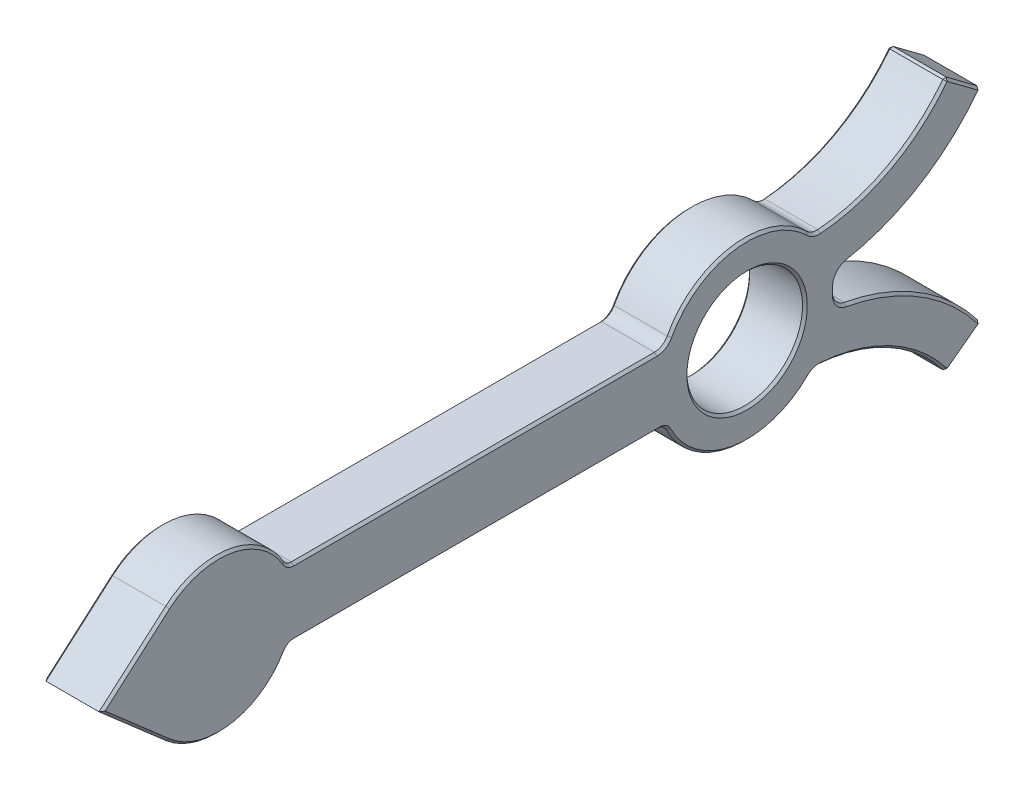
ISO-10303-21;
HEADER;
FILE_DESCRIPTION(('STEP AP214'),'2;1');
FILE_NAME('part.step','',(''),(''),'','','');
FILE_SCHEMA(('AUTOMOTIVE_DESIGN { 1 0 10303 214 1 1 1 1 }'));
ENDSEC;
DATA;
#1=APPLICATION_CONTEXT('core data for automotive mechanical design processes');
#2=APPLICATION_PROTOCOL_DEFINITION('international standard','automotive_design',2000,#1);
#3=PRODUCT_CONTEXT('',#1,'mechanical');
#4=PRODUCT('Part','Part','',(#3));
#5=PRODUCT_RELATED_PRODUCT_CATEGORY('part','',(#4));
#6=PRODUCT_DEFINITION_FORMATION('','',#4);
#7=PRODUCT_DEFINITION_CONTEXT('part definition',#1,'design');
#8=PRODUCT_DEFINITION('design','',#6,#7);
#9=PRODUCT_DEFINITION_SHAPE('','',#8);
#10=(LENGTH_UNIT() NAMED_UNIT(*) SI_UNIT(.MILLI.,.METRE.));
#11=(NAMED_UNIT(*) PLANE_ANGLE_UNIT() SI_UNIT($,.RADIAN.));
#12=(NAMED_UNIT(*) SI_UNIT($,.STERADIAN.) SOLID_ANGLE_UNIT());
#13=UNCERTAINTY_MEASURE_WITH_UNIT(LENGTH_MEASURE(1.E-05),#10,'distance_accuracy_value','');
#14=(GEOMETRIC_REPRESENTATION_CONTEXT(3) GLOBAL_UNCERTAINTY_ASSIGNED_CONTEXT((#13)) GLOBAL_UNIT_ASSIGNED_CONTEXT((#10,
#11,#12)) REPRESENTATION_CONTEXT('',''));
#15=CARTESIAN_POINT('',(0.,0.,0.));
#16=DIRECTION('',(0.,0.,1.));
#17=DIRECTION('',(1.,0.,0.));
#18=AXIS2_PLACEMENT_3D('',#15,#16,#17);
#19=CARTESIAN_POINT('',(6.,-4.5,9.06445806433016));
#20=DIRECTION('',(-1.,0.,0.));
#21=DIRECTION('',(0.,0.,1.));
#22=AXIS2_PLACEMENT_3D('',#19,#20,#21);
#23=PLANE('',#22);
#24=CARTESIAN_POINT('',(6.,0.,0.));
#25=DIRECTION('',(-1.,0.,0.));
#26=DIRECTION('',(0.,0.,1.));
#27=AXIS2_PLACEMENT_3D('',#24,#25,#26);
#28=CIRCLE('',#27,6.25000000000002);
#29=CARTESIAN_POINT('',(6.,0.,6.25000000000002));
#30=VERTEX_POINT('',#29);
#31=EDGE_CURVE('E475',#30,#30,#28,.T.);
#32=ORIENTED_EDGE('',*,*,#31,.T.);
#33=EDGE_LOOP('',(#32));
#34=FACE_BOUND('',#33,.T.);
#35=CARTESIAN_POINT('',(6.,-4.50000000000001,47.0361619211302));
#36=DIRECTION('',(-1.,0.,0.));
#37=DIRECTION('',(0.,0.,1.));
#38=AXIS2_PLACEMENT_3D('',#35,#36,#37);
#39=CIRCLE('',#38,1.24999999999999);
#40=CARTESIAN_POINT('',(6.,-3.87500000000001,48.1186936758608));
#41=VERTEX_POINT('',#40);
#42=CARTESIAN_POINT('',(6.,-3.25000000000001,47.0361619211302));
#43=VERTEX_POINT('',#42);
#44=EDGE_CURVE('E470',#41,#43,#39,.T.);
#45=ORIENTED_EDGE('',*,*,#44,.T.);
#46=DIRECTION('',(0.,0.,-1.));
#47=VECTOR('',#46,1.);
#48=CARTESIAN_POINT('',(6.,-3.25,9.06445806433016));
#49=LINE('',#48,#47);
#50=CARTESIAN_POINT('',(6.,-3.25,9.06445806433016));
#51=VERTEX_POINT('',#50);
#52=EDGE_CURVE('E472',#43,#51,#49,.T.);
#53=ORIENTED_EDGE('',*,*,#52,.T.);
#54=CARTESIAN_POINT('',(6.,-4.5,9.06445806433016));
#55=DIRECTION('',(-1.,0.,0.));
#56=DIRECTION('',(0.,0.,1.));
#57=AXIS2_PLACEMENT_3D('',#54,#55,#56);
#58=CIRCLE('',#57,1.25);
#59=CARTESIAN_POINT('',(6.,-3.94416996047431,7.9448362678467));
#60=VERTEX_POINT('',#59);
#61=EDGE_CURVE('E428',#51,#60,#58,.T.);
#62=ORIENTED_EDGE('',*,*,#61,.T.);
#63=CARTESIAN_POINT('',(6.,0.,0.));
#64=DIRECTION('',(-1.,0.,0.));
#65=DIRECTION('',(0.,0.,1.));
#66=AXIS2_PLACEMENT_3D('',#63,#64,#65);
#67=CIRCLE('',#66,8.87000000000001);
#68=CARTESIAN_POINT('',(6.,-6.30090812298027,-6.24303266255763));
#69=VERTEX_POINT('',#68);
#70=EDGE_CURVE('E430',#60,#69,#67,.F.);
#71=ORIENTED_EDGE('',*,*,#70,.T.);
#72=CARTESIAN_POINT('',(6.,-7.54404106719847,-7.47474711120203));
#73=DIRECTION('',(-1.,0.,0.));
#74=DIRECTION('',(0.,0.,1.));
#75=AXIS2_PLACEMENT_3D('',#72,#73,#74);
#76=CIRCLE('',#75,1.74999999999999);
#77=CARTESIAN_POINT('',(6.,-5.7987120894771,-7.60252331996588));
#78=VERTEX_POINT('',#77);
#79=EDGE_CURVE('E432',#69,#78,#76,.T.);
#80=ORIENTED_EDGE('',*,*,#79,.T.);
#81=CARTESIAN_POINT('',(6.,-24.,-6.27));
#82=DIRECTION('',(-1.,0.,0.));
#83=DIRECTION('',(0.,0.,1.));
#84=AXIS2_PLACEMENT_3D('',#81,#82,#83);
#85=CIRCLE('',#84,18.25);
#86=CARTESIAN_POINT('',(6.,-12.893920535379,-20.7516262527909));
#87=VERTEX_POINT('',#86);
#88=EDGE_CURVE('E434',#78,#87,#85,.T.);
#89=ORIENTED_EDGE('',*,*,#88,.T.);
#90=DIRECTION('',(0.,0.597625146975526,-0.801775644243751));
#91=VECTOR('',#90,1.);
#92=CARTESIAN_POINT('',(6.,-24.1826963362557,-5.60657163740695));
#93=LINE('',#92,#91);
#94=CARTESIAN_POINT('',(6.,-10.5032359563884,-23.9589756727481));
#95=VERTEX_POINT('',#94);
#96=EDGE_CURVE('E436',#87,#95,#93,.T.);
#97=ORIENTED_EDGE('',*,*,#96,.T.);
#98=CARTESIAN_POINT('',(6.,-24.,-6.27));
#99=DIRECTION('',(-1.,0.,0.));
#100=DIRECTION('',(0.,0.,1.));
#101=AXIS2_PLACEMENT_3D('',#98,#99,#100);
#102=CIRCLE('',#101,22.25);
#103=CARTESIAN_POINT('',(6.,-2.11726378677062,-10.2959602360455));
#104=VERTEX_POINT('',#103);
#105=EDGE_CURVE('E438',#95,#104,#102,.F.);
#106=ORIENTED_EDGE('',*,*,#105,.T.);
#107=CARTESIAN_POINT('',(6.,-0.396149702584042,-10.6126087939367));
#108=DIRECTION('',(-1.,0.,0.));
#109=DIRECTION('',(0.,0.,1.));
#110=AXIS2_PLACEMENT_3D('',#107,#108,#109);
#111=CIRCLE('',#110,1.75);
#112=CARTESIAN_POINT('',(6.,-0.330870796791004,-8.86382674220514));
#113=VERTEX_POINT('',#112);
#114=EDGE_CURVE('E440',#104,#113,#111,.T.);
#115=ORIENTED_EDGE('',*,*,#114,.T.);
#116=CARTESIAN_POINT('',(6.,0.,0.));
#117=DIRECTION('',(-1.,0.,0.));
#118=DIRECTION('',(0.,0.,1.));
#119=AXIS2_PLACEMENT_3D('',#116,#117,#118);
#120=CIRCLE('',#119,8.87000000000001);
#121=CARTESIAN_POINT('',(6.,0.330870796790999,-8.86382674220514));
#122=VERTEX_POINT('',#121);
#123=EDGE_CURVE('E442',#113,#122,#120,.F.);
#124=ORIENTED_EDGE('',*,*,#123,.T.);
#125=CARTESIAN_POINT('',(6.,0.396149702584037,-10.6126087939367));
#126=DIRECTION('',(-1.,0.,0.));
#127=DIRECTION('',(0.,0.,1.));
#128=AXIS2_PLACEMENT_3D('',#125,#126,#127);
#129=CIRCLE('',#128,1.75);
#130=CARTESIAN_POINT('',(6.,2.11726378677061,-10.2959602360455));
#131=VERTEX_POINT('',#130);
#132=EDGE_CURVE('E444',#122,#131,#129,.T.);
#133=ORIENTED_EDGE('',*,*,#132,.T.);
#134=CARTESIAN_POINT('',(6.,24.,-6.27));
#135=DIRECTION('',(-1.,0.,0.));
#136=DIRECTION('',(0.,0.,1.));
#137=AXIS2_PLACEMENT_3D('',#134,#135,#136);
#138=CIRCLE('',#137,22.25);
#139=CARTESIAN_POINT('',(6.,10.5032359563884,-23.9589756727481));
#140=VERTEX_POINT('',#139);
#141=EDGE_CURVE('E446',#131,#140,#138,.F.);
#142=ORIENTED_EDGE('',*,*,#141,.T.);
#143=DIRECTION('',(0.,0.597625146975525,0.801775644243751));
#144=VECTOR('',#143,1.);
#145=CARTESIAN_POINT('',(6.,20.9682939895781,-9.91902322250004));
#146=LINE('',#145,#144);
#147=CARTESIAN_POINT('',(6.,12.893920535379,-20.7516262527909));
#148=VERTEX_POINT('',#147);
#149=EDGE_CURVE('E448',#140,#148,#146,.T.);
#150=ORIENTED_EDGE('',*,*,#149,.T.);
#151=CARTESIAN_POINT('',(6.,24.,-6.27));
#152=DIRECTION('',(-1.,0.,0.));
#153=DIRECTION('',(0.,0.,1.));
#154=AXIS2_PLACEMENT_3D('',#151,#152,#153);
#155=CIRCLE('',#154,18.25);
#156=CARTESIAN_POINT('',(6.,5.7987120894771,-7.60252331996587));
#157=VERTEX_POINT('',#156);
#158=EDGE_CURVE('E450',#148,#157,#155,.T.);
#159=ORIENTED_EDGE('',*,*,#158,.T.);
#160=CARTESIAN_POINT('',(6.,7.54404106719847,-7.47474711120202));
#161=DIRECTION('',(-1.,0.,0.));
#162=DIRECTION('',(0.,0.,1.));
#163=AXIS2_PLACEMENT_3D('',#160,#161,#162);
#164=CIRCLE('',#163,1.75);
#165=CARTESIAN_POINT('',(6.,6.30090812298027,-6.24303266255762));
#166=VERTEX_POINT('',#165);
#167=EDGE_CURVE('E452',#157,#166,#164,.T.);
#168=ORIENTED_EDGE('',*,*,#167,.T.);
#169=CARTESIAN_POINT('',(6.,0.,0.));
#170=DIRECTION('',(-1.,0.,0.));
#171=DIRECTION('',(0.,0.,1.));
#172=AXIS2_PLACEMENT_3D('',#169,#170,#171);
#173=CIRCLE('',#172,8.87);
#174=CARTESIAN_POINT('',(6.,4.17608286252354,7.82542215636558));
#175=VERTEX_POINT('',#174);
#176=EDGE_CURVE('E454',#166,#175,#173,.F.);
#177=ORIENTED_EDGE('',*,*,#176,.T.);
#178=CARTESIAN_POINT('',(6.,4.99999999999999,9.36933295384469));
#179=DIRECTION('',(-1.,0.,0.));
#180=DIRECTION('',(0.,0.,1.));
#181=AXIS2_PLACEMENT_3D('',#178,#179,#180);
#182=CIRCLE('',#181,1.74999999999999);
#183=CARTESIAN_POINT('',(6.,3.25,9.36933295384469));
#184=VERTEX_POINT('',#183);
#185=EDGE_CURVE('E456',#175,#184,#182,.T.);
#186=ORIENTED_EDGE('',*,*,#185,.T.);
#187=DIRECTION('',(0.,0.,1.));
#188=VECTOR('',#187,1.);
#189=CARTESIAN_POINT('',(6.,3.25,9.06445806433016));
#190=LINE('',#189,#188);
#191=CARTESIAN_POINT('',(6.,3.25,47.0361619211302));
#192=VERTEX_POINT('',#191);
#193=EDGE_CURVE('E458',#184,#192,#190,.T.);
#194=ORIENTED_EDGE('',*,*,#193,.T.);
#195=CARTESIAN_POINT('',(6.,4.5,47.0361619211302));
#196=DIRECTION('',(-1.,0.,0.));
#197=DIRECTION('',(0.,0.,1.));
#198=AXIS2_PLACEMENT_3D('',#195,#196,#197);
#199=CIRCLE('',#198,1.24999999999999);
#200=CARTESIAN_POINT('',(6.,3.875,48.1186936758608));
#201=VERTEX_POINT('',#200);
#202=EDGE_CURVE('E460',#192,#201,#199,.T.);
#203=ORIENTED_EDGE('',*,*,#202,.T.);
#204=CARTESIAN_POINT('',(6.,0.,54.8303905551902));
#205=DIRECTION('',(-1.,0.,0.));
#206=DIRECTION('',(0.,0.,1.));
#207=AXIS2_PLACEMENT_3D('',#204,#205,#206);
#208=CIRCLE('',#207,7.75);
#209=CARTESIAN_POINT('',(6.,5.84011629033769,59.9250487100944));
#210=VERTEX_POINT('',#209);
#211=EDGE_CURVE('E462',#201,#210,#208,.F.);
#212=ORIENTED_EDGE('',*,*,#211,.T.);
#213=DIRECTION('',(0.,-0.657375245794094,0.753563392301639));
#214=VECTOR('',#213,1.);
#215=CARTESIAN_POINT('',(6.,26.5667257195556,36.1656902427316));
#216=LINE('',#215,#214);
#217=CARTESIAN_POINT('',(6.,0.,66.6196997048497));
#218=VERTEX_POINT('',#217);
#219=EDGE_CURVE('E464',#210,#218,#216,.T.);
#220=ORIENTED_EDGE('',*,*,#219,.T.);
#221=DIRECTION('',(0.,-0.657375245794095,-0.753563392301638));
#222=VECTOR('',#221,1.);
#223=CARTESIAN_POINT('',(6.,-30.4560056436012,31.7073249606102));
#224=LINE('',#223,#222);
#225=CARTESIAN_POINT('',(6.,-5.84011629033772,59.9250487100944));
#226=VERTEX_POINT('',#225);
#227=EDGE_CURVE('E466',#218,#226,#224,.T.);
#228=ORIENTED_EDGE('',*,*,#227,.T.);
#229=CARTESIAN_POINT('',(6.,0.,54.8303905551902));
#230=DIRECTION('',(-1.,0.,0.));
#231=DIRECTION('',(0.,0.,1.));
#232=AXIS2_PLACEMENT_3D('',#229,#230,#231);
#233=CIRCLE('',#232,7.75000000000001);
#234=EDGE_CURVE('E468',#226,#41,#233,.F.);
#235=ORIENTED_EDGE('',*,*,#234,.T.);
#236=EDGE_LOOP('',(#45,#53,#62,#71,#80,#89,#97,#106,#115,#124,#133,#142,#150,#159,#168,#177,
#186,#194,#203,#212,#220,#228,#235));
#237=FACE_BOUND('',#236,.T.);
#238=ADVANCED_FACE('F30',(#34,#237),#23,.F.);
#239=CARTESIAN_POINT('',(0.,-4.5,9.06445806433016));
#240=DIRECTION('',(-1.,0.,0.));
#241=DIRECTION('',(0.,0.,1.));
#242=AXIS2_PLACEMENT_3D('',#239,#240,#241);
#243=PLANE('',#242);
#244=CARTESIAN_POINT('',(0.,0.,0.));
#245=DIRECTION('',(-1.,0.,0.));
#246=DIRECTION('',(0.,0.,1.));
#247=AXIS2_PLACEMENT_3D('',#244,#245,#246);
#248=CIRCLE('',#247,6.24999999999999);
#249=CARTESIAN_POINT('',(0.,0.,6.24999999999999));
#250=VERTEX_POINT('',#249);
#251=EDGE_CURVE('E419',#250,#250,#248,.F.);
#252=ORIENTED_EDGE('',*,*,#251,.T.);
#253=EDGE_LOOP('',(#252));
#254=FACE_BOUND('',#253,.T.);
#255=CARTESIAN_POINT('',(0.,-7.54404106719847,-7.47474711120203));
#256=DIRECTION('',(-1.,0.,0.));
#257=DIRECTION('',(0.,0.,1.));
#258=AXIS2_PLACEMENT_3D('',#255,#256,#257);
#259=CIRCLE('',#258,1.75);
#260=CARTESIAN_POINT('',(0.,-5.7987120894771,-7.60252331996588));
#261=VERTEX_POINT('',#260);
#262=CARTESIAN_POINT('',(0.,-6.30090812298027,-6.24303266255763));
#263=VERTEX_POINT('',#262);
#264=EDGE_CURVE('E414',#261,#263,#259,.F.);
#265=ORIENTED_EDGE('',*,*,#264,.T.);
#266=CARTESIAN_POINT('',(0.,0.,0.));
#267=DIRECTION('',(-1.,0.,0.));
#268=DIRECTION('',(0.,0.,1.));
#269=AXIS2_PLACEMENT_3D('',#266,#267,#268);
#270=CIRCLE('',#269,8.87);
#271=CARTESIAN_POINT('',(0.,-3.94416996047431,7.9448362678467));
#272=VERTEX_POINT('',#271);
#273=EDGE_CURVE('E416',#263,#272,#270,.T.);
#274=ORIENTED_EDGE('',*,*,#273,.T.);
#275=CARTESIAN_POINT('',(0.,-4.5,9.06445806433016));
#276=DIRECTION('',(-1.,0.,0.));
#277=DIRECTION('',(0.,0.,1.));
#278=AXIS2_PLACEMENT_3D('',#275,#276,#277);
#279=CIRCLE('',#278,1.25);
#280=CARTESIAN_POINT('',(0.,-3.25,9.06445806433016));
#281=VERTEX_POINT('',#280);
#282=EDGE_CURVE('E396',#272,#281,#279,.F.);
#283=ORIENTED_EDGE('',*,*,#282,.T.);
#284=DIRECTION('',(0.,0.,1.));
#285=VECTOR('',#284,1.);
#286=CARTESIAN_POINT('',(0.,-3.25000000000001,47.0361619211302));
#287=LINE('',#286,#285);
#288=CARTESIAN_POINT('',(0.,-3.25000000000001,47.0361619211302));
#289=VERTEX_POINT('',#288);
#290=EDGE_CURVE('E394',#281,#289,#287,.T.);
#291=ORIENTED_EDGE('',*,*,#290,.T.);
#292=CARTESIAN_POINT('',(0.,-4.50000000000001,47.0361619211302));
#293=DIRECTION('',(-1.,0.,0.));
#294=DIRECTION('',(0.,0.,1.));
#295=AXIS2_PLACEMENT_3D('',#292,#293,#294);
#296=CIRCLE('',#295,1.25);
#297=CARTESIAN_POINT('',(0.,-3.87500000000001,48.1186936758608));
#298=VERTEX_POINT('',#297);
#299=EDGE_CURVE('E392',#289,#298,#296,.F.);
#300=ORIENTED_EDGE('',*,*,#299,.T.);
#301=CARTESIAN_POINT('',(0.,0.,54.8303905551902));
#302=DIRECTION('',(-1.,0.,0.));
#303=DIRECTION('',(0.,0.,1.));
#304=AXIS2_PLACEMENT_3D('',#301,#302,#303);
#305=CIRCLE('',#304,7.75);
#306=CARTESIAN_POINT('',(0.,-5.84011629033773,59.9250487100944));
#307=VERTEX_POINT('',#306);
#308=EDGE_CURVE('E390',#298,#307,#305,.T.);
#309=ORIENTED_EDGE('',*,*,#308,.T.);
#310=DIRECTION('',(0.,0.657375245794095,0.753563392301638));
#311=VECTOR('',#310,1.);
#312=CARTESIAN_POINT('',(0.,0.188390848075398,66.8356561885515));
#313=LINE('',#312,#311);
#314=CARTESIAN_POINT('',(0.,0.,66.6196997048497));
#315=VERTEX_POINT('',#314);
#316=EDGE_CURVE('E388',#307,#315,#313,.T.);
#317=ORIENTED_EDGE('',*,*,#316,.T.);
#318=DIRECTION('',(0.,0.657375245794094,-0.753563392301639));
#319=VECTOR('',#318,1.);
#320=CARTESIAN_POINT('',(0.,5.8401162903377,59.9250487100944));
#321=LINE('',#320,#319);
#322=CARTESIAN_POINT('',(0.,5.8401162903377,59.9250487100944));
#323=VERTEX_POINT('',#322);
#324=EDGE_CURVE('E386',#315,#323,#321,.T.);
#325=ORIENTED_EDGE('',*,*,#324,.T.);
#326=CARTESIAN_POINT('',(0.,0.,54.8303905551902));
#327=DIRECTION('',(-1.,0.,0.));
#328=DIRECTION('',(0.,0.,1.));
#329=AXIS2_PLACEMENT_3D('',#326,#327,#328);
#330=CIRCLE('',#329,7.75);
#331=CARTESIAN_POINT('',(0.,3.87499999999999,48.1186936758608));
#332=VERTEX_POINT('',#331);
#333=EDGE_CURVE('E384',#323,#332,#330,.T.);
#334=ORIENTED_EDGE('',*,*,#333,.T.);
#335=CARTESIAN_POINT('',(0.,4.5,47.0361619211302));
#336=DIRECTION('',(-1.,0.,0.));
#337=DIRECTION('',(0.,0.,1.));
#338=AXIS2_PLACEMENT_3D('',#335,#336,#337);
#339=CIRCLE('',#338,1.25);
#340=CARTESIAN_POINT('',(0.,3.25,47.0361619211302));
#341=VERTEX_POINT('',#340);
#342=EDGE_CURVE('E382',#332,#341,#339,.F.);
#343=ORIENTED_EDGE('',*,*,#342,.T.);
#344=DIRECTION('',(0.,0.,-1.));
#345=VECTOR('',#344,1.);
#346=CARTESIAN_POINT('',(0.,3.25,9.36933295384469));
#347=LINE('',#346,#345);
#348=CARTESIAN_POINT('',(0.,3.25,9.36933295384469));
#349=VERTEX_POINT('',#348);
#350=EDGE_CURVE('E380',#341,#349,#347,.T.);
#351=ORIENTED_EDGE('',*,*,#350,.T.);
#352=CARTESIAN_POINT('',(0.,4.99999999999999,9.36933295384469));
#353=DIRECTION('',(-1.,0.,0.));
#354=DIRECTION('',(0.,0.,1.));
#355=AXIS2_PLACEMENT_3D('',#352,#353,#354);
#356=CIRCLE('',#355,1.75);
#357=CARTESIAN_POINT('',(0.,4.17608286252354,7.82542215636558));
#358=VERTEX_POINT('',#357);
#359=EDGE_CURVE('E378',#349,#358,#356,.F.);
#360=ORIENTED_EDGE('',*,*,#359,.T.);
#361=CARTESIAN_POINT('',(0.,0.,0.));
#362=DIRECTION('',(-1.,0.,0.));
#363=DIRECTION('',(0.,0.,1.));
#364=AXIS2_PLACEMENT_3D('',#361,#362,#363);
#365=CIRCLE('',#364,8.87);
#366=CARTESIAN_POINT('',(0.,6.30090812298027,-6.24303266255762));
#367=VERTEX_POINT('',#366);
#368=EDGE_CURVE('E352',#358,#367,#365,.T.);
#369=ORIENTED_EDGE('',*,*,#368,.T.);
#370=CARTESIAN_POINT('',(0.,7.54404106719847,-7.47474711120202));
#371=DIRECTION('',(-1.,0.,0.));
#372=DIRECTION('',(0.,0.,1.));
#373=AXIS2_PLACEMENT_3D('',#370,#371,#372);
#374=CIRCLE('',#373,1.75);
#375=CARTESIAN_POINT('',(0.,5.7987120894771,-7.60252331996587));
#376=VERTEX_POINT('',#375);
#377=EDGE_CURVE('E345',#367,#376,#374,.F.);
#378=ORIENTED_EDGE('',*,*,#377,.T.);
#379=CARTESIAN_POINT('',(0.,24.,-6.27));
#380=DIRECTION('',(-1.,0.,0.));
#381=DIRECTION('',(0.,0.,1.));
#382=AXIS2_PLACEMENT_3D('',#379,#380,#381);
#383=CIRCLE('',#382,18.25);
#384=CARTESIAN_POINT('',(0.,12.893920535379,-20.7516262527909));
#385=VERTEX_POINT('',#384);
#386=EDGE_CURVE('E349',#376,#385,#383,.F.);
#387=ORIENTED_EDGE('',*,*,#386,.T.);
#388=DIRECTION('',(0.,-0.597625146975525,-0.801775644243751));
#389=VECTOR('',#388,1.);
#390=CARTESIAN_POINT('',(0.,10.3529902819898,-24.1605457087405));
#391=LINE('',#390,#389);
#392=CARTESIAN_POINT('',(0.,10.5032359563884,-23.9589756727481));
#393=VERTEX_POINT('',#392);
#394=EDGE_CURVE('E398',#385,#393,#391,.T.);
#395=ORIENTED_EDGE('',*,*,#394,.T.);
#396=CARTESIAN_POINT('',(0.,24.,-6.27));
#397=DIRECTION('',(-1.,0.,0.));
#398=DIRECTION('',(0.,0.,1.));
#399=AXIS2_PLACEMENT_3D('',#396,#397,#398);
#400=CIRCLE('',#399,22.25);
#401=CARTESIAN_POINT('',(0.,2.11726378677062,-10.2959602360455));
#402=VERTEX_POINT('',#401);
#403=EDGE_CURVE('E400',#393,#402,#400,.T.);
#404=ORIENTED_EDGE('',*,*,#403,.T.);
#405=CARTESIAN_POINT('',(0.,0.396149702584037,-10.6126087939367));
#406=DIRECTION('',(-1.,0.,0.));
#407=DIRECTION('',(0.,0.,1.));
#408=AXIS2_PLACEMENT_3D('',#405,#406,#407);
#409=CIRCLE('',#408,1.75);
#410=CARTESIAN_POINT('',(0.,0.330870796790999,-8.86382674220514));
#411=VERTEX_POINT('',#410);
#412=EDGE_CURVE('E402',#402,#411,#409,.F.);
#413=ORIENTED_EDGE('',*,*,#412,.T.);
#414=CARTESIAN_POINT('',(0.,0.,0.));
#415=DIRECTION('',(-1.,0.,0.));
#416=DIRECTION('',(0.,0.,1.));
#417=AXIS2_PLACEMENT_3D('',#414,#415,#416);
#418=CIRCLE('',#417,8.87000000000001);
#419=CARTESIAN_POINT('',(0.,-0.330870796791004,-8.86382674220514));
#420=VERTEX_POINT('',#419);
#421=EDGE_CURVE('E404',#411,#420,#418,.T.);
#422=ORIENTED_EDGE('',*,*,#421,.T.);
#423=CARTESIAN_POINT('',(0.,-0.396149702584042,-10.6126087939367));
#424=DIRECTION('',(-1.,0.,0.));
#425=DIRECTION('',(0.,0.,1.));
#426=AXIS2_PLACEMENT_3D('',#423,#424,#425);
#427=CIRCLE('',#426,1.75);
#428=CARTESIAN_POINT('',(0.,-2.11726378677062,-10.2959602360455));
#429=VERTEX_POINT('',#428);
#430=EDGE_CURVE('E406',#420,#429,#427,.F.);
#431=ORIENTED_EDGE('',*,*,#430,.T.);
#432=CARTESIAN_POINT('',(0.,-24.,-6.27));
#433=DIRECTION('',(-1.,0.,0.));
#434=DIRECTION('',(0.,0.,1.));
#435=AXIS2_PLACEMENT_3D('',#432,#433,#434);
#436=CIRCLE('',#435,22.25);
#437=CARTESIAN_POINT('',(0.,-10.5032359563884,-23.9589756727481));
#438=VERTEX_POINT('',#437);
#439=EDGE_CURVE('E408',#429,#438,#436,.T.);
#440=ORIENTED_EDGE('',*,*,#439,.T.);
#441=DIRECTION('',(0.,-0.597625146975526,0.801775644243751));
#442=VECTOR('',#441,1.);
#443=CARTESIAN_POINT('',(0.,-13.0423034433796,-20.5525553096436));
#444=LINE('',#443,#442);
#445=CARTESIAN_POINT('',(0.,-12.893920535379,-20.7516262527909));
#446=VERTEX_POINT('',#445);
#447=EDGE_CURVE('E410',#438,#446,#444,.T.);
#448=ORIENTED_EDGE('',*,*,#447,.T.);
#449=CARTESIAN_POINT('',(0.,-24.,-6.27));
#450=DIRECTION('',(-1.,0.,0.));
#451=DIRECTION('',(0.,0.,1.));
#452=AXIS2_PLACEMENT_3D('',#449,#450,#451);
#453=CIRCLE('',#452,18.25);
#454=EDGE_CURVE('E412',#446,#261,#453,.F.);
#455=ORIENTED_EDGE('',*,*,#454,.T.);
#456=EDGE_LOOP('',(#265,#274,#283,#291,#300,#309,#317,#325,#334,#343,#351,#360,#369,#378,#387,
#395,#404,#413,#422,#431,#440,#448,#455));
#457=FACE_BOUND('',#456,.T.);
#458=ADVANCED_FACE('F347',(#254,#457),#243,.T.);
#459=CARTESIAN_POINT('',(6.,-4.5,9.06445806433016));
#460=DIRECTION('',(-1.,0.,0.));
#461=DIRECTION('',(0.,0.,1.));
#462=AXIS2_PLACEMENT_3D('',#459,#460,#461);
#463=CYLINDRICAL_SURFACE('',#462,1.);
#464=DIRECTION('',(-1.,0.,0.));
#465=VECTOR('',#464,1.);
#466=CARTESIAN_POINT('',(6.,-3.5,9.06445806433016));
#467=LINE('',#466,#465);
#468=CARTESIAN_POINT('',(5.75,-3.5,9.06445806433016));
#469=VERTEX_POINT('',#468);
#470=CARTESIAN_POINT('',(0.249999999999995,-3.5,9.06445806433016));
#471=VERTEX_POINT('',#470);
#472=EDGE_CURVE('E758',#469,#471,#467,.T.);
#473=ORIENTED_EDGE('',*,*,#472,.T.);
#474=CARTESIAN_POINT('',(0.249999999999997,-4.5,9.06445806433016));
#475=DIRECTION('',(-1.,0.,0.));
#476=DIRECTION('',(0.,0.,1.));
#477=AXIS2_PLACEMENT_3D('',#474,#475,#476);
#478=CIRCLE('',#477,1.);
#479=CARTESIAN_POINT('',(0.249999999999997,-4.05533596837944,8.16876062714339));
#480=VERTEX_POINT('',#479);
#481=EDGE_CURVE('E538',#471,#480,#478,.T.);
#482=ORIENTED_EDGE('',*,*,#481,.T.);
#483=DIRECTION('',(-1.,0.,0.));
#484=VECTOR('',#483,1.);
#485=CARTESIAN_POINT('',(6.,-4.05533596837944,8.16876062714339));
#486=LINE('',#485,#484);
#487=CARTESIAN_POINT('',(5.75,-4.05533596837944,8.16876062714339));
#488=VERTEX_POINT('',#487);
#489=EDGE_CURVE('E370',#488,#480,#486,.T.);
#490=ORIENTED_EDGE('',*,*,#489,.F.);
#491=CARTESIAN_POINT('',(5.75,-4.5,9.06445806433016));
#492=DIRECTION('',(-1.,0.,0.));
#493=DIRECTION('',(0.,0.,1.));
#494=AXIS2_PLACEMENT_3D('',#491,#492,#493);
#495=CIRCLE('',#494,1.);
#496=EDGE_CURVE('E536',#488,#469,#495,.F.);
#497=ORIENTED_EDGE('',*,*,#496,.T.);
#498=EDGE_LOOP('',(#473,#482,#490,#497));
#499=FACE_BOUND('',#498,.T.);
#500=ADVANCED_FACE('F978',(#499),#463,.F.);
#501=CARTESIAN_POINT('',(6.,0.,0.));
#502=DIRECTION('',(-1.,0.,0.));
#503=DIRECTION('',(0.,0.,1.));
#504=AXIS2_PLACEMENT_3D('',#501,#502,#503);
#505=CYLINDRICAL_SURFACE('',#504,9.12);
#506=ORIENTED_EDGE('',*,*,#489,.T.);
#507=CARTESIAN_POINT('',(0.249999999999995,0.,0.));
#508=DIRECTION('',(-1.,0.,0.));
#509=DIRECTION('',(0.,0.,1.));
#510=AXIS2_PLACEMENT_3D('',#507,#508,#509);
#511=CIRCLE('',#510,9.12);
#512=CARTESIAN_POINT('',(0.249999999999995,-6.47849854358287,-6.41899186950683));
#513=VERTEX_POINT('',#512);
#514=EDGE_CURVE('E518',#480,#513,#511,.F.);
#515=ORIENTED_EDGE('',*,*,#514,.T.);
#516=DIRECTION('',(-1.,0.,0.));
#517=VECTOR('',#516,1.);
#518=CARTESIAN_POINT('',(6.,-6.47849854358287,-6.41899186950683));
#519=LINE('',#518,#517);
#520=CARTESIAN_POINT('',(5.75,-6.47849854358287,-6.41899186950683));
#521=VERTEX_POINT('',#520);
#522=EDGE_CURVE('E373',#521,#513,#519,.T.);
#523=ORIENTED_EDGE('',*,*,#522,.F.);
#524=CARTESIAN_POINT('',(5.75,0.,0.));
#525=DIRECTION('',(-1.,0.,0.));
#526=DIRECTION('',(0.,0.,1.));
#527=AXIS2_PLACEMENT_3D('',#524,#525,#526);
#528=CIRCLE('',#527,9.12);
#529=EDGE_CURVE('E516',#521,#488,#528,.T.);
#530=ORIENTED_EDGE('',*,*,#529,.T.);
#531=EDGE_LOOP('',(#506,#515,#523,#530));
#532=FACE_BOUND('',#531,.T.);
#533=ADVANCED_FACE('F976',(#532),#505,.T.);
#534=CARTESIAN_POINT('',(6.,-7.54404106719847,-7.47474711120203));
#535=DIRECTION('',(-1.,0.,0.));
#536=DIRECTION('',(0.,0.,1.));
#537=AXIS2_PLACEMENT_3D('',#534,#535,#536);
#538=CYLINDRICAL_SURFACE('',#537,1.5);
#539=ORIENTED_EDGE('',*,*,#522,.T.);
#540=CARTESIAN_POINT('',(0.249999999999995,-7.54404106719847,-7.47474711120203));
#541=DIRECTION('',(-1.,0.,0.));
#542=DIRECTION('',(0.,0.,1.));
#543=AXIS2_PLACEMENT_3D('',#540,#541,#542);
#544=CIRCLE('',#543,1.5);
#545=CARTESIAN_POINT('',(0.249999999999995,-6.04804480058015,-7.58426957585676));
#546=VERTEX_POINT('',#545);
#547=EDGE_CURVE('E522',#513,#546,#544,.T.);
#548=ORIENTED_EDGE('',*,*,#547,.T.);
#549=DIRECTION('',(-1.,0.,0.));
#550=VECTOR('',#549,1.);
#551=CARTESIAN_POINT('',(6.,-6.04804480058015,-7.58426957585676));
#552=LINE('',#551,#550);
#553=CARTESIAN_POINT('',(5.75,-6.04804480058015,-7.58426957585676));
#554=VERTEX_POINT('',#553);
#555=EDGE_CURVE('E814',#554,#546,#552,.T.);
#556=ORIENTED_EDGE('',*,*,#555,.F.);
#557=CARTESIAN_POINT('',(5.75,-7.54404106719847,-7.47474711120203));
#558=DIRECTION('',(-1.,0.,0.));
#559=DIRECTION('',(0.,0.,1.));
#560=AXIS2_PLACEMENT_3D('',#557,#558,#559);
#561=CIRCLE('',#560,1.5);
#562=EDGE_CURVE('E520',#554,#521,#561,.F.);
#563=ORIENTED_EDGE('',*,*,#562,.T.);
#564=EDGE_LOOP('',(#539,#548,#556,#563));
#565=FACE_BOUND('',#564,.T.);
#566=ADVANCED_FACE('F820',(#565),#538,.F.);
#567=CARTESIAN_POINT('',(6.,-24.,-6.27));
#568=DIRECTION('',(-1.,0.,0.));
#569=DIRECTION('',(0.,0.,1.));
#570=AXIS2_PLACEMENT_3D('',#567,#568,#569);
#571=CYLINDRICAL_SURFACE('',#570,18.);
#572=ORIENTED_EDGE('',*,*,#555,.T.);
#573=CARTESIAN_POINT('',(0.249999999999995,-24.,-6.27));
#574=DIRECTION('',(-1.,0.,0.));
#575=DIRECTION('',(0.,0.,1.));
#576=AXIS2_PLACEMENT_3D('',#573,#574,#575);
#577=CIRCLE('',#576,18.);
#578=CARTESIAN_POINT('',(0.249999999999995,-13.0460586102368,-20.5532478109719));
#579=VERTEX_POINT('',#578);
#580=EDGE_CURVE('E492',#546,#579,#577,.T.);
#581=ORIENTED_EDGE('',*,*,#580,.T.);
#582=DIRECTION('',(-1.,0.,0.));
#583=VECTOR('',#582,1.);
#584=CARTESIAN_POINT('',(6.,-13.0460586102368,-20.5532478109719));
#585=LINE('',#584,#583);
#586=CARTESIAN_POINT('',(5.75,-13.0460586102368,-20.5532478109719));
#587=VERTEX_POINT('',#586);
#588=EDGE_CURVE('E489',#579,#587,#585,.F.);
#589=ORIENTED_EDGE('',*,*,#588,.T.);
#590=CARTESIAN_POINT('',(5.75,-24.,-6.27));
#591=DIRECTION('',(-1.,0.,0.));
#592=DIRECTION('',(0.,0.,1.));
#593=AXIS2_PLACEMENT_3D('',#590,#591,#592);
#594=CIRCLE('',#593,18.);
#595=EDGE_CURVE('E487',#587,#554,#594,.F.);
#596=ORIENTED_EDGE('',*,*,#595,.T.);
#597=EDGE_LOOP('',(#572,#581,#589,#596));
#598=FACE_BOUND('',#597,.T.);
#599=ADVANCED_FACE('F841',(#598),#571,.F.);
#600=CARTESIAN_POINT('',(6.,-13.2427473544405,-20.7019615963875));
#601=DIRECTION('',(0.,0.801775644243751,0.597625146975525));
#602=DIRECTION('',(0.,-0.597625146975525,0.801775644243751));
#603=AXIS2_PLACEMENT_3D('',#600,#601,#602);
#604=PLANE('',#603);
#605=DIRECTION('',(-1.,0.,0.));
#606=VECTOR('',#605,1.);
#607=CARTESIAN_POINT('',(6.,-13.0943644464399,-20.9010325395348));
#608=LINE('',#607,#606);
#609=CARTESIAN_POINT('',(5.75,-13.0943644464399,-20.9010325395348));
#610=VERTEX_POINT('',#609);
#611=CARTESIAN_POINT('',(0.249999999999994,-13.0943644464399,-20.9010325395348));
#612=VERTEX_POINT('',#611);
#613=EDGE_CURVE('E482',#610,#612,#608,.T.);
#614=ORIENTED_EDGE('',*,*,#613,.T.);
#615=DIRECTION('',(0.,0.597625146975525,-0.801775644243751));
#616=VECTOR('',#615,1.);
#617=CARTESIAN_POINT('',(0.249999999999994,-10.5534341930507,-24.3099519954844));
#618=LINE('',#617,#616);
#619=CARTESIAN_POINT('',(0.249999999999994,-10.7036798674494,-24.108381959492));
#620=VERTEX_POINT('',#619);
#621=EDGE_CURVE('E485',#612,#620,#618,.T.);
#622=ORIENTED_EDGE('',*,*,#621,.T.);
#623=DIRECTION('',(1.,0.,0.));
#624=VECTOR('',#623,1.);
#625=CARTESIAN_POINT('',(6.,-10.7036798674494,-24.108381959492));
#626=LINE('',#625,#624);
#627=CARTESIAN_POINT('',(5.75,-10.7036798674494,-24.108381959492));
#628=VERTEX_POINT('',#627);
#629=EDGE_CURVE('E480',#620,#628,#626,.T.);
#630=ORIENTED_EDGE('',*,*,#629,.T.);
#631=DIRECTION('',(0.,-0.597625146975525,0.801775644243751));
#632=VECTOR('',#631,1.);
#633=CARTESIAN_POINT('',(5.75,-13.2427473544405,-20.7019615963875));
#634=LINE('',#633,#632);
#635=EDGE_CURVE('E478',#628,#610,#634,.T.);
#636=ORIENTED_EDGE('',*,*,#635,.T.);
#637=EDGE_LOOP('',(#614,#622,#630,#636));
#638=FACE_BOUND('',#637,.T.);
#639=ADVANCED_FACE('F1084',(#638),#604,.F.);
#640=CARTESIAN_POINT('',(6.,-24.,-6.27));
#641=DIRECTION('',(-1.,0.,0.));
#642=DIRECTION('',(0.,0.,1.));
#643=AXIS2_PLACEMENT_3D('',#640,#641,#642);
#644=CYLINDRICAL_SURFACE('',#643,22.5);
#645=DIRECTION('',(-1.,0.,0.));
#646=VECTOR('',#645,1.);
#647=CARTESIAN_POINT('',(6.,-10.3515869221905,-24.1577282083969));
#648=LINE('',#647,#646);
#649=CARTESIAN_POINT('',(5.75,-10.3515869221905,-24.1577282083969));
#650=VERTEX_POINT('',#649);
#651=CARTESIAN_POINT('',(0.249999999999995,-10.3515869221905,-24.1577282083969));
#652=VERTEX_POINT('',#651);
#653=EDGE_CURVE('E496',#650,#652,#648,.T.);
#654=ORIENTED_EDGE('',*,*,#653,.T.);
#655=CARTESIAN_POINT('',(0.249999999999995,-24.,-6.27));
#656=DIRECTION('',(-1.,0.,0.));
#657=DIRECTION('',(0.,0.,1.));
#658=AXIS2_PLACEMENT_3D('',#655,#656,#657);
#659=CIRCLE('',#658,22.5);
#660=CARTESIAN_POINT('',(0.249999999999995,-1.87139034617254,-10.3411957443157));
#661=VERTEX_POINT('',#660);
#662=EDGE_CURVE('E499',#652,#661,#659,.F.);
#663=ORIENTED_EDGE('',*,*,#662,.T.);
#664=DIRECTION('',(-1.,0.,0.));
#665=VECTOR('',#664,1.);
#666=CARTESIAN_POINT('',(6.,-1.87139034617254,-10.3411957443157));
#667=LINE('',#666,#665);
#668=CARTESIAN_POINT('',(5.75,-1.87139034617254,-10.3411957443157));
#669=VERTEX_POINT('',#668);
#670=EDGE_CURVE('E811',#669,#661,#667,.T.);
#671=ORIENTED_EDGE('',*,*,#670,.F.);
#672=CARTESIAN_POINT('',(5.75,-24.,-6.27));
#673=DIRECTION('',(-1.,0.,0.));
#674=DIRECTION('',(0.,0.,1.));
#675=AXIS2_PLACEMENT_3D('',#672,#673,#674);
#676=CIRCLE('',#675,22.5);
#677=EDGE_CURVE('E494',#669,#650,#676,.T.);
#678=ORIENTED_EDGE('',*,*,#677,.T.);
#679=EDGE_LOOP('',(#654,#663,#671,#678));
#680=FACE_BOUND('',#679,.T.);
#681=ADVANCED_FACE('F1080',(#680),#644,.T.);
#682=CARTESIAN_POINT('',(6.,-0.396149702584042,-10.6126087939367));
#683=DIRECTION('',(-1.,0.,0.));
#684=DIRECTION('',(0.,0.,1.));
#685=AXIS2_PLACEMENT_3D('',#682,#683,#684);
#686=CYLINDRICAL_SURFACE('',#685,1.5);
#687=ORIENTED_EDGE('',*,*,#670,.T.);
#688=CARTESIAN_POINT('',(0.249999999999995,-0.396149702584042,-10.6126087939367));
#689=DIRECTION('',(-1.,0.,0.));
#690=DIRECTION('',(0.,0.,1.));
#691=AXIS2_PLACEMENT_3D('',#688,#689,#690);
#692=CIRCLE('',#691,1.5);
#693=CARTESIAN_POINT('',(0.249999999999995,-0.340196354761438,-9.11365274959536));
#694=VERTEX_POINT('',#693);
#695=EDGE_CURVE('E526',#661,#694,#692,.T.);
#696=ORIENTED_EDGE('',*,*,#695,.T.);
#697=DIRECTION('',(-1.,0.,0.));
#698=VECTOR('',#697,1.);
#699=CARTESIAN_POINT('',(6.,-0.340196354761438,-9.11365274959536));
#700=LINE('',#699,#698);
#701=CARTESIAN_POINT('',(5.75,-0.340196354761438,-9.11365274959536));
#702=VERTEX_POINT('',#701);
#703=EDGE_CURVE('E808',#702,#694,#700,.T.);
#704=ORIENTED_EDGE('',*,*,#703,.F.);
#705=CARTESIAN_POINT('',(5.75,-0.396149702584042,-10.6126087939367));
#706=DIRECTION('',(-1.,0.,0.));
#707=DIRECTION('',(0.,0.,1.));
#708=AXIS2_PLACEMENT_3D('',#705,#706,#707);
#709=CIRCLE('',#708,1.5);
#710=EDGE_CURVE('E524',#702,#669,#709,.F.);
#711=ORIENTED_EDGE('',*,*,#710,.T.);
#712=EDGE_LOOP('',(#687,#696,#704,#711));
#713=FACE_BOUND('',#712,.T.);
#714=ADVANCED_FACE('F1076',(#713),#686,.F.);
#715=CARTESIAN_POINT('',(6.,0.,0.));
#716=DIRECTION('',(-1.,0.,0.));
#717=DIRECTION('',(0.,0.,1.));
#718=AXIS2_PLACEMENT_3D('',#715,#716,#717);
#719=CYLINDRICAL_SURFACE('',#718,9.12);
#720=ORIENTED_EDGE('',*,*,#703,.T.);
#721=CARTESIAN_POINT('',(0.249999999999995,0.,0.));
#722=DIRECTION('',(-1.,0.,0.));
#723=DIRECTION('',(0.,0.,1.));
#724=AXIS2_PLACEMENT_3D('',#721,#722,#723);
#725=CIRCLE('',#724,9.12);
#726=CARTESIAN_POINT('',(0.249999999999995,0.340196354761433,-9.11365274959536));
#727=VERTEX_POINT('',#726);
#728=EDGE_CURVE('E530',#694,#727,#725,.F.);
#729=ORIENTED_EDGE('',*,*,#728,.T.);
#730=DIRECTION('',(-1.,0.,0.));
#731=VECTOR('',#730,1.);
#732=CARTESIAN_POINT('',(6.,0.340196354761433,-9.11365274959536));
#733=LINE('',#732,#731);
#734=CARTESIAN_POINT('',(5.75,0.340196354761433,-9.11365274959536));
#735=VERTEX_POINT('',#734);
#736=EDGE_CURVE('E805',#735,#727,#733,.T.);
#737=ORIENTED_EDGE('',*,*,#736,.F.);
#738=CARTESIAN_POINT('',(5.75,0.,0.));
#739=DIRECTION('',(-1.,0.,0.));
#740=DIRECTION('',(0.,0.,1.));
#741=AXIS2_PLACEMENT_3D('',#738,#739,#740);
#742=CIRCLE('',#741,9.12);
#743=EDGE_CURVE('E528',#735,#702,#742,.T.);
#744=ORIENTED_EDGE('',*,*,#743,.T.);
#745=EDGE_LOOP('',(#720,#729,#737,#744));
#746=FACE_BOUND('',#745,.T.);
#747=ADVANCED_FACE('F1072',(#746),#719,.T.);
#748=CARTESIAN_POINT('',(6.,0.396149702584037,-10.6126087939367));
#749=DIRECTION('',(-1.,0.,0.));
#750=DIRECTION('',(0.,0.,1.));
#751=AXIS2_PLACEMENT_3D('',#748,#749,#750);
#752=CYLINDRICAL_SURFACE('',#751,1.5);
#753=ORIENTED_EDGE('',*,*,#736,.T.);
#754=CARTESIAN_POINT('',(0.249999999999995,0.396149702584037,-10.6126087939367));
#755=DIRECTION('',(-1.,0.,0.));
#756=DIRECTION('',(0.,0.,1.));
#757=AXIS2_PLACEMENT_3D('',#754,#755,#756);
#758=CIRCLE('',#757,1.5);
#759=CARTESIAN_POINT('',(0.249999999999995,1.87139034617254,-10.3411957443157));
#760=VERTEX_POINT('',#759);
#761=EDGE_CURVE('E534',#727,#760,#758,.T.);
#762=ORIENTED_EDGE('',*,*,#761,.T.);
#763=DIRECTION('',(-1.,0.,0.));
#764=VECTOR('',#763,1.);
#765=CARTESIAN_POINT('',(6.,1.87139034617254,-10.3411957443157));
#766=LINE('',#765,#764);
#767=CARTESIAN_POINT('',(5.75,1.87139034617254,-10.3411957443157));
#768=VERTEX_POINT('',#767);
#769=EDGE_CURVE('E802',#768,#760,#766,.T.);
#770=ORIENTED_EDGE('',*,*,#769,.F.);
#771=CARTESIAN_POINT('',(5.75,0.396149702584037,-10.6126087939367));
#772=DIRECTION('',(-1.,0.,0.));
#773=DIRECTION('',(0.,0.,1.));
#774=AXIS2_PLACEMENT_3D('',#771,#772,#773);
#775=CIRCLE('',#774,1.5);
#776=EDGE_CURVE('E532',#768,#735,#775,.F.);
#777=ORIENTED_EDGE('',*,*,#776,.T.);
#778=EDGE_LOOP('',(#753,#762,#770,#777));
#779=FACE_BOUND('',#778,.T.);
#780=ADVANCED_FACE('F1068',(#779),#752,.F.);
#781=CARTESIAN_POINT('',(6.,24.,-6.27));
#782=DIRECTION('',(-1.,0.,0.));
#783=DIRECTION('',(0.,0.,1.));
#784=AXIS2_PLACEMENT_3D('',#781,#782,#783);
#785=CYLINDRICAL_SURFACE('',#784,22.5);
#786=ORIENTED_EDGE('',*,*,#769,.T.);
#787=CARTESIAN_POINT('',(0.249999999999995,24.,-6.27));
#788=DIRECTION('',(-1.,0.,0.));
#789=DIRECTION('',(0.,0.,1.));
#790=AXIS2_PLACEMENT_3D('',#787,#788,#789);
#791=CIRCLE('',#790,22.5);
#792=CARTESIAN_POINT('',(0.249999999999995,10.3515869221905,-24.1577282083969));
#793=VERTEX_POINT('',#792);
#794=EDGE_CURVE('E514',#760,#793,#791,.F.);
#795=ORIENTED_EDGE('',*,*,#794,.T.);
#796=DIRECTION('',(-1.,0.,0.));
#797=VECTOR('',#796,1.);
#798=CARTESIAN_POINT('',(6.,10.3515869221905,-24.157728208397));
#799=LINE('',#798,#797);
#800=CARTESIAN_POINT('',(5.75,10.3515869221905,-24.1577282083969));
#801=VERTEX_POINT('',#800);
#802=EDGE_CURVE('E512',#793,#801,#799,.F.);
#803=ORIENTED_EDGE('',*,*,#802,.T.);
#804=CARTESIAN_POINT('',(5.75,24.,-6.27));
#805=DIRECTION('',(-1.,0.,0.));
#806=DIRECTION('',(0.,0.,1.));
#807=AXIS2_PLACEMENT_3D('',#804,#805,#806);
#808=CIRCLE('',#807,22.5);
#809=EDGE_CURVE('E510',#801,#768,#808,.T.);
#810=ORIENTED_EDGE('',*,*,#809,.T.);
#811=EDGE_LOOP('',(#786,#795,#803,#810));
#812=FACE_BOUND('',#811,.T.);
#813=ADVANCED_FACE('F1065',(#812),#785,.T.);
#814=CARTESIAN_POINT('',(6.,13.2427473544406,-20.7019615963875));
#815=DIRECTION('',(0.,-0.801775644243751,0.597625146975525));
#816=DIRECTION('',(0.,-0.597625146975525,-0.801775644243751));
#817=AXIS2_PLACEMENT_3D('',#814,#815,#816);
#818=PLANE('',#817);
#819=DIRECTION('',(0.,-0.597625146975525,-0.801775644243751));
#820=VECTOR('',#819,1.);
#821=CARTESIAN_POINT('',(5.75,13.2427473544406,-20.7019615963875));
#822=LINE('',#821,#820);
#823=CARTESIAN_POINT('',(5.75,13.0943644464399,-20.9010325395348));
#824=VERTEX_POINT('',#823);
#825=CARTESIAN_POINT('',(5.75,10.7036798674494,-24.108381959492));
#826=VERTEX_POINT('',#825);
#827=EDGE_CURVE('E501',#824,#826,#822,.T.);
#828=ORIENTED_EDGE('',*,*,#827,.T.);
#829=DIRECTION('',(-1.,0.,0.));
#830=VECTOR('',#829,1.);
#831=CARTESIAN_POINT('',(6.,10.7036798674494,-24.108381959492));
#832=LINE('',#831,#830);
#833=CARTESIAN_POINT('',(0.249999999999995,10.7036798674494,-24.108381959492));
#834=VERTEX_POINT('',#833);
#835=EDGE_CURVE('E507',#826,#834,#832,.T.);
#836=ORIENTED_EDGE('',*,*,#835,.T.);
#837=DIRECTION('',(0.,0.597625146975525,0.801775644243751));
#838=VECTOR('',#837,1.);
#839=CARTESIAN_POINT('',(0.249999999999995,13.2427473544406,-20.7019615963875));
#840=LINE('',#839,#838);
#841=CARTESIAN_POINT('',(0.249999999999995,13.0943644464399,-20.9010325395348));
#842=VERTEX_POINT('',#841);
#843=EDGE_CURVE('E505',#834,#842,#840,.T.);
#844=ORIENTED_EDGE('',*,*,#843,.T.);
#845=DIRECTION('',(1.,0.,0.));
#846=VECTOR('',#845,1.);
#847=CARTESIAN_POINT('',(6.,13.0943644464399,-20.9010325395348));
#848=LINE('',#847,#846);
#849=EDGE_CURVE('E503',#842,#824,#848,.T.);
#850=ORIENTED_EDGE('',*,*,#849,.T.);
#851=EDGE_LOOP('',(#828,#836,#844,#850));
#852=FACE_BOUND('',#851,.T.);
#853=ADVANCED_FACE('F906',(#852),#818,.F.);
#854=CARTESIAN_POINT('',(6.,24.,-6.27));
#855=DIRECTION('',(-1.,0.,0.));
#856=DIRECTION('',(0.,0.,1.));
#857=AXIS2_PLACEMENT_3D('',#854,#855,#856);
#858=CYLINDRICAL_SURFACE('',#857,18.);
#859=DIRECTION('',(-1.,0.,0.));
#860=VECTOR('',#859,1.);
#861=CARTESIAN_POINT('',(6.,13.0460586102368,-20.5532478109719));
#862=LINE('',#861,#860);
#863=CARTESIAN_POINT('',(5.75,13.0460586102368,-20.5532478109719));
#864=VERTEX_POINT('',#863);
#865=CARTESIAN_POINT('',(0.249999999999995,13.0460586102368,-20.5532478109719));
#866=VERTEX_POINT('',#865);
#867=EDGE_CURVE('E39',#864,#866,#862,.T.);
#868=ORIENTED_EDGE('',*,*,#867,.T.);
#869=CARTESIAN_POINT('',(0.249999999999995,24.,-6.27));
#870=DIRECTION('',(-1.,0.,0.));
#871=DIRECTION('',(0.,0.,1.));
#872=AXIS2_PLACEMENT_3D('',#869,#870,#871);
#873=CIRCLE('',#872,18.);
#874=CARTESIAN_POINT('',(0.249999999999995,6.04804480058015,-7.58426957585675));
#875=VERTEX_POINT('',#874);
#876=EDGE_CURVE('E11',#866,#875,#873,.T.);
#877=ORIENTED_EDGE('',*,*,#876,.T.);
#878=DIRECTION('',(-1.,0.,0.));
#879=VECTOR('',#878,1.);
#880=CARTESIAN_POINT('',(6.,6.04804480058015,-7.58426957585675));
#881=LINE('',#880,#879);
#882=CARTESIAN_POINT('',(5.75,6.04804480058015,-7.58426957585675));
#883=VERTEX_POINT('',#882);
#884=EDGE_CURVE('E799',#883,#875,#881,.T.);
#885=ORIENTED_EDGE('',*,*,#884,.F.);
#886=CARTESIAN_POINT('',(5.75,24.,-6.27));
#887=DIRECTION('',(-1.,0.,0.));
#888=DIRECTION('',(0.,0.,1.));
#889=AXIS2_PLACEMENT_3D('',#886,#887,#888);
#890=CIRCLE('',#889,18.);
#891=EDGE_CURVE('E50',#883,#864,#890,.F.);
#892=ORIENTED_EDGE('',*,*,#891,.T.);
#893=EDGE_LOOP('',(#868,#877,#885,#892));
#894=FACE_BOUND('',#893,.T.);
#895=ADVANCED_FACE('F1059',(#894),#858,.F.);
#896=CARTESIAN_POINT('',(6.,7.54404106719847,-7.47474711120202));
#897=DIRECTION('',(-1.,0.,0.));
#898=DIRECTION('',(0.,0.,1.));
#899=AXIS2_PLACEMENT_3D('',#896,#897,#898);
#900=CYLINDRICAL_SURFACE('',#899,1.5);
#901=ORIENTED_EDGE('',*,*,#884,.T.);
#902=CARTESIAN_POINT('',(0.249999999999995,7.54404106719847,-7.47474711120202));
#903=DIRECTION('',(-1.,0.,0.));
#904=DIRECTION('',(0.,0.,1.));
#905=AXIS2_PLACEMENT_3D('',#902,#903,#904);
#906=CIRCLE('',#905,1.5);
#907=CARTESIAN_POINT('',(0.249999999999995,6.47849854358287,-6.41899186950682));
#908=VERTEX_POINT('',#907);
#909=EDGE_CURVE('E361',#875,#908,#906,.T.);
#910=ORIENTED_EDGE('',*,*,#909,.T.);
#911=DIRECTION('',(-1.,0.,0.));
#912=VECTOR('',#911,1.);
#913=CARTESIAN_POINT('',(6.,6.47849854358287,-6.41899186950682));
#914=LINE('',#913,#912);
#915=CARTESIAN_POINT('',(5.75,6.47849854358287,-6.41899186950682));
#916=VERTEX_POINT('',#915);
#917=EDGE_CURVE('E796',#916,#908,#914,.T.);
#918=ORIENTED_EDGE('',*,*,#917,.F.);
#919=CARTESIAN_POINT('',(5.75,7.54404106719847,-7.47474711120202));
#920=DIRECTION('',(-1.,0.,0.));
#921=DIRECTION('',(0.,0.,1.));
#922=AXIS2_PLACEMENT_3D('',#919,#920,#921);
#923=CIRCLE('',#922,1.5);
#924=EDGE_CURVE('E580',#916,#883,#923,.F.);
#925=ORIENTED_EDGE('',*,*,#924,.T.);
#926=EDGE_LOOP('',(#901,#910,#918,#925));
#927=FACE_BOUND('',#926,.T.);
#928=ADVANCED_FACE('F1055',(#927),#900,.F.);
#929=CARTESIAN_POINT('',(6.,0.,0.));
#930=DIRECTION('',(-1.,0.,0.));
#931=DIRECTION('',(0.,0.,1.));
#932=AXIS2_PLACEMENT_3D('',#929,#930,#931);
#933=CYLINDRICAL_SURFACE('',#932,9.12);
#934=ORIENTED_EDGE('',*,*,#917,.T.);
#935=CARTESIAN_POINT('',(0.249999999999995,0.,0.));
#936=DIRECTION('',(-1.,0.,0.));
#937=DIRECTION('',(0.,0.,1.));
#938=AXIS2_PLACEMENT_3D('',#935,#936,#937);
#939=CIRCLE('',#938,9.12);
#940=CARTESIAN_POINT('',(0.249999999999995,4.29378531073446,8.04598084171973));
#941=VERTEX_POINT('',#940);
#942=EDGE_CURVE('E578',#908,#941,#939,.F.);
#943=ORIENTED_EDGE('',*,*,#942,.T.);
#944=DIRECTION('',(-1.,0.,0.));
#945=VECTOR('',#944,1.);
#946=CARTESIAN_POINT('',(6.,4.29378531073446,8.04598084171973));
#947=LINE('',#946,#945);
#948=CARTESIAN_POINT('',(5.75,4.29378531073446,8.04598084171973));
#949=VERTEX_POINT('',#948);
#950=EDGE_CURVE('E793',#949,#941,#947,.T.);
#951=ORIENTED_EDGE('',*,*,#950,.F.);
#952=CARTESIAN_POINT('',(5.75,0.,0.));
#953=DIRECTION('',(-1.,0.,0.));
#954=DIRECTION('',(0.,0.,1.));
#955=AXIS2_PLACEMENT_3D('',#952,#953,#954);
#956=CIRCLE('',#955,9.12);
#957=EDGE_CURVE('E576',#949,#916,#956,.T.);
#958=ORIENTED_EDGE('',*,*,#957,.T.);
#959=EDGE_LOOP('',(#934,#943,#951,#958));
#960=FACE_BOUND('',#959,.T.);
#961=ADVANCED_FACE('F1051',(#960),#933,.T.);
#962=CARTESIAN_POINT('',(6.,4.99999999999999,9.36933295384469));
#963=DIRECTION('',(-1.,0.,0.));
#964=DIRECTION('',(0.,0.,1.));
#965=AXIS2_PLACEMENT_3D('',#962,#963,#964);
#966=CYLINDRICAL_SURFACE('',#965,1.5);
#967=ORIENTED_EDGE('',*,*,#950,.T.);
#968=CARTESIAN_POINT('',(0.249999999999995,4.99999999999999,9.36933295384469));
#969=DIRECTION('',(-1.,0.,0.));
#970=DIRECTION('',(0.,0.,1.));
#971=AXIS2_PLACEMENT_3D('',#968,#969,#970);
#972=CIRCLE('',#971,1.5);
#973=CARTESIAN_POINT('',(0.249999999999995,3.49999999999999,9.36933295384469));
#974=VERTEX_POINT('',#973);
#975=EDGE_CURVE('E574',#941,#974,#972,.T.);
#976=ORIENTED_EDGE('',*,*,#975,.T.);
#977=DIRECTION('',(-1.,0.,0.));
#978=VECTOR('',#977,1.);
#979=CARTESIAN_POINT('',(6.,3.49999999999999,9.36933295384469));
#980=LINE('',#979,#978);
#981=CARTESIAN_POINT('',(5.75,3.49999999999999,9.36933295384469));
#982=VERTEX_POINT('',#981);
#983=EDGE_CURVE('E790',#982,#974,#980,.T.);
#984=ORIENTED_EDGE('',*,*,#983,.F.);
#985=CARTESIAN_POINT('',(5.75,4.99999999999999,9.36933295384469));
#986=DIRECTION('',(-1.,0.,0.));
#987=DIRECTION('',(0.,0.,1.));
#988=AXIS2_PLACEMENT_3D('',#985,#986,#987);
#989=CIRCLE('',#988,1.5);
#990=EDGE_CURVE('E572',#982,#949,#989,.F.);
#991=ORIENTED_EDGE('',*,*,#990,.T.);
#992=EDGE_LOOP('',(#967,#976,#984,#991));
#993=FACE_BOUND('',#992,.T.);
#994=ADVANCED_FACE('F1047',(#993),#966,.F.);
#995=CARTESIAN_POINT('',(6.,3.49999999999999,47.0361619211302));
#996=DIRECTION('',(0.,-1.,0.));
#997=DIRECTION('',(0.,0.,-1.));
#998=AXIS2_PLACEMENT_3D('',#995,#996,#997);
#999=PLANE('',#998);
#1000=ORIENTED_EDGE('',*,*,#983,.T.);
#1001=DIRECTION('',(0.,0.,1.));
#1002=VECTOR('',#1001,1.);
#1003=CARTESIAN_POINT('',(0.249999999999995,3.49999999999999,47.0361619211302));
#1004=LINE('',#1003,#1002);
#1005=CARTESIAN_POINT('',(0.249999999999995,3.5,47.0361619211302));
#1006=VERTEX_POINT('',#1005);
#1007=EDGE_CURVE('E570',#974,#1006,#1004,.T.);
#1008=ORIENTED_EDGE('',*,*,#1007,.T.);
#1009=DIRECTION('',(-1.,0.,0.));
#1010=VECTOR('',#1009,1.);
#1011=CARTESIAN_POINT('',(6.,3.5,47.0361619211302));
#1012=LINE('',#1011,#1010);
#1013=CARTESIAN_POINT('',(5.75,3.5,47.0361619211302));
#1014=VERTEX_POINT('',#1013);
#1015=EDGE_CURVE('E787',#1014,#1006,#1012,.T.);
#1016=ORIENTED_EDGE('',*,*,#1015,.F.);
#1017=DIRECTION('',(0.,0.,-1.));
#1018=VECTOR('',#1017,1.);
#1019=CARTESIAN_POINT('',(5.75,3.49999999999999,47.0361619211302));
#1020=LINE('',#1019,#1018);
#1021=EDGE_CURVE('E568',#1014,#982,#1020,.T.);
#1022=ORIENTED_EDGE('',*,*,#1021,.T.);
#1023=EDGE_LOOP('',(#1000,#1008,#1016,#1022));
#1024=FACE_BOUND('',#1023,.T.);
#1025=ADVANCED_FACE('F1043',(#1024),#999,.F.);
#1026=CARTESIAN_POINT('',(6.,4.5,47.0361619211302));
#1027=DIRECTION('',(-1.,0.,0.));
#1028=DIRECTION('',(0.,0.,1.));
#1029=AXIS2_PLACEMENT_3D('',#1026,#1027,#1028);
#1030=CYLINDRICAL_SURFACE('',#1029,0.999999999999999);
#1031=ORIENTED_EDGE('',*,*,#1015,.T.);
#1032=CARTESIAN_POINT('',(0.249999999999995,4.5,47.0361619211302));
#1033=DIRECTION('',(-1.,0.,0.));
#1034=DIRECTION('',(0.,0.,1.));
#1035=AXIS2_PLACEMENT_3D('',#1032,#1033,#1034);
#1036=CIRCLE('',#1035,0.999999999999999);
#1037=CARTESIAN_POINT('',(0.249999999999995,4.,47.9021873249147));
#1038=VERTEX_POINT('',#1037);
#1039=EDGE_CURVE('E566',#1006,#1038,#1036,.T.);
#1040=ORIENTED_EDGE('',*,*,#1039,.T.);
#1041=DIRECTION('',(-1.,0.,0.));
#1042=VECTOR('',#1041,1.);
#1043=CARTESIAN_POINT('',(6.,4.,47.9021873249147));
#1044=LINE('',#1043,#1042);
#1045=CARTESIAN_POINT('',(5.75,4.,47.9021873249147));
#1046=VERTEX_POINT('',#1045);
#1047=EDGE_CURVE('E784',#1046,#1038,#1044,.T.);
#1048=ORIENTED_EDGE('',*,*,#1047,.F.);
#1049=CARTESIAN_POINT('',(5.75,4.5,47.0361619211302));
#1050=DIRECTION('',(-1.,0.,0.));
#1051=DIRECTION('',(0.,0.,1.));
#1052=AXIS2_PLACEMENT_3D('',#1049,#1050,#1051);
#1053=CIRCLE('',#1052,0.999999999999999);
#1054=EDGE_CURVE('E564',#1046,#1014,#1053,.F.);
#1055=ORIENTED_EDGE('',*,*,#1054,.T.);
#1056=EDGE_LOOP('',(#1031,#1040,#1048,#1055));
#1057=FACE_BOUND('',#1056,.T.);
#1058=ADVANCED_FACE('F1039',(#1057),#1030,.F.);
#1059=CARTESIAN_POINT('',(6.,0.,54.8303905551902));
#1060=DIRECTION('',(-1.,0.,0.));
#1061=DIRECTION('',(0.,0.,1.));
#1062=AXIS2_PLACEMENT_3D('',#1059,#1060,#1061);
#1063=CYLINDRICAL_SURFACE('',#1062,7.99999999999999);
#1064=ORIENTED_EDGE('',*,*,#1047,.T.);
#1065=CARTESIAN_POINT('',(0.249999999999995,0.,54.8303905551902));
#1066=DIRECTION('',(-1.,0.,0.));
#1067=DIRECTION('',(0.,0.,1.));
#1068=AXIS2_PLACEMENT_3D('',#1065,#1066,#1067);
#1069=CIRCLE('',#1068,7.99999999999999);
#1070=CARTESIAN_POINT('',(0.249999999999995,6.0285071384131,60.0893925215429));
#1071=VERTEX_POINT('',#1070);
#1072=EDGE_CURVE('E562',#1038,#1071,#1069,.F.);
#1073=ORIENTED_EDGE('',*,*,#1072,.T.);
#1074=DIRECTION('',(-1.,0.,0.));
#1075=VECTOR('',#1074,1.);
#1076=CARTESIAN_POINT('',(6.,6.0285071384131,60.0893925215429));
#1077=LINE('',#1076,#1075);
#1078=CARTESIAN_POINT('',(5.75,6.0285071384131,60.0893925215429));
#1079=VERTEX_POINT('',#1078);
#1080=EDGE_CURVE('E781',#1079,#1071,#1077,.T.);
#1081=ORIENTED_EDGE('',*,*,#1080,.F.);
#1082=CARTESIAN_POINT('',(5.75,0.,54.8303905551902));
#1083=DIRECTION('',(-1.,0.,0.));
#1084=DIRECTION('',(0.,0.,1.));
#1085=AXIS2_PLACEMENT_3D('',#1082,#1083,#1084);
#1086=CIRCLE('',#1085,7.99999999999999);
#1087=EDGE_CURVE('E560',#1079,#1046,#1086,.T.);
#1088=ORIENTED_EDGE('',*,*,#1087,.T.);
#1089=EDGE_LOOP('',(#1064,#1073,#1081,#1088));
#1090=FACE_BOUND('',#1089,.T.);
#1091=ADVANCED_FACE('F1035',(#1090),#1063,.T.);
#1092=CARTESIAN_POINT('',(6.,6.0285071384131,60.0893925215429));
#1093=DIRECTION('',(0.,-0.753563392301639,-0.657375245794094));
#1094=DIRECTION('',(0.,0.657375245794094,-0.753563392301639));
#1095=AXIS2_PLACEMENT_3D('',#1092,#1093,#1094);
#1096=PLANE('',#1095);
#1097=ORIENTED_EDGE('',*,*,#1080,.T.);
#1098=DIRECTION('',(0.,-0.657375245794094,0.753563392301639));
#1099=VECTOR('',#1098,1.);
#1100=CARTESIAN_POINT('',(0.249999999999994,0.,67.));
#1101=LINE('',#1100,#1099);
#1102=CARTESIAN_POINT('',(0.249999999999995,0.,67.));
#1103=VERTEX_POINT('',#1102);
#1104=EDGE_CURVE('E558',#1071,#1103,#1101,.T.);
#1105=ORIENTED_EDGE('',*,*,#1104,.T.);
#1106=DIRECTION('',(-1.,0.,0.));
#1107=VECTOR('',#1106,1.);
#1108=CARTESIAN_POINT('',(6.,0.,67.));
#1109=LINE('',#1108,#1107);
#1110=CARTESIAN_POINT('',(5.75,0.,67.));
#1111=VERTEX_POINT('',#1110);
#1112=EDGE_CURVE('E778',#1111,#1103,#1109,.T.);
#1113=ORIENTED_EDGE('',*,*,#1112,.F.);
#1114=DIRECTION('',(0.,0.657375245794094,-0.753563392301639));
#1115=VECTOR('',#1114,1.);
#1116=CARTESIAN_POINT('',(5.75,6.0285071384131,60.0893925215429));
#1117=LINE('',#1116,#1115);
#1118=EDGE_CURVE('E556',#1111,#1079,#1117,.T.);
#1119=ORIENTED_EDGE('',*,*,#1118,.T.);
#1120=EDGE_LOOP('',(#1097,#1105,#1113,#1119));
#1121=FACE_BOUND('',#1120,.T.);
#1122=ADVANCED_FACE('F1031',(#1121),#1096,.F.);
#1123=CARTESIAN_POINT('',(6.,0.,67.));
#1124=DIRECTION('',(0.,0.753563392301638,-0.657375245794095));
#1125=DIRECTION('',(0.,0.657375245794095,0.753563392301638));
#1126=AXIS2_PLACEMENT_3D('',#1123,#1124,#1125);
#1127=PLANE('',#1126);
#1128=ORIENTED_EDGE('',*,*,#1112,.T.);
#1129=DIRECTION('',(0.,-0.657375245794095,-0.753563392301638));
#1130=VECTOR('',#1129,1.);
#1131=CARTESIAN_POINT('',(0.249999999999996,-6.02850713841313,60.0893925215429));
#1132=LINE('',#1131,#1130);
#1133=CARTESIAN_POINT('',(0.249999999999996,-6.02850713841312,60.0893925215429));
#1134=VERTEX_POINT('',#1133);
#1135=EDGE_CURVE('E554',#1103,#1134,#1132,.T.);
#1136=ORIENTED_EDGE('',*,*,#1135,.T.);
#1137=DIRECTION('',(-1.,0.,0.));
#1138=VECTOR('',#1137,1.);
#1139=CARTESIAN_POINT('',(6.,-6.02850713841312,60.0893925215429));
#1140=LINE('',#1139,#1138);
#1141=CARTESIAN_POINT('',(5.75,-6.02850713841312,60.0893925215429));
#1142=VERTEX_POINT('',#1141);
#1143=EDGE_CURVE('E775',#1142,#1134,#1140,.T.);
#1144=ORIENTED_EDGE('',*,*,#1143,.F.);
#1145=DIRECTION('',(0.,0.657375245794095,0.753563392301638));
#1146=VECTOR('',#1145,1.);
#1147=CARTESIAN_POINT('',(5.75,0.,67.));
#1148=LINE('',#1147,#1146);
#1149=EDGE_CURVE('E552',#1142,#1111,#1148,.T.);
#1150=ORIENTED_EDGE('',*,*,#1149,.T.);
#1151=EDGE_LOOP('',(#1128,#1136,#1144,#1150));
#1152=FACE_BOUND('',#1151,.T.);
#1153=ADVANCED_FACE('F1027',(#1152),#1127,.F.);
#1154=CARTESIAN_POINT('',(6.,0.,54.8303905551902));
#1155=DIRECTION('',(-1.,0.,0.));
#1156=DIRECTION('',(0.,0.,1.));
#1157=AXIS2_PLACEMENT_3D('',#1154,#1155,#1156);
#1158=CYLINDRICAL_SURFACE('',#1157,8.);
#1159=ORIENTED_EDGE('',*,*,#1143,.T.);
#1160=CARTESIAN_POINT('',(0.249999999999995,0.,54.8303905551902));
#1161=DIRECTION('',(-1.,0.,0.));
#1162=DIRECTION('',(0.,0.,1.));
#1163=AXIS2_PLACEMENT_3D('',#1160,#1161,#1162);
#1164=CIRCLE('',#1163,8.);
#1165=CARTESIAN_POINT('',(0.249999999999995,-4.00000000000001,47.9021873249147));
#1166=VERTEX_POINT('',#1165);
#1167=EDGE_CURVE('E550',#1134,#1166,#1164,.F.);
#1168=ORIENTED_EDGE('',*,*,#1167,.T.);
#1169=DIRECTION('',(-1.,0.,0.));
#1170=VECTOR('',#1169,1.);
#1171=CARTESIAN_POINT('',(6.,-4.00000000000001,47.9021873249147));
#1172=LINE('',#1171,#1170);
#1173=CARTESIAN_POINT('',(5.75,-4.00000000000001,47.9021873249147));
#1174=VERTEX_POINT('',#1173);
#1175=EDGE_CURVE('E770',#1174,#1166,#1172,.T.);
#1176=ORIENTED_EDGE('',*,*,#1175,.F.);
#1177=CARTESIAN_POINT('',(5.75,0.,54.8303905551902));
#1178=DIRECTION('',(-1.,0.,0.));
#1179=DIRECTION('',(0.,0.,1.));
#1180=AXIS2_PLACEMENT_3D('',#1177,#1178,#1179);
#1181=CIRCLE('',#1180,8.);
#1182=EDGE_CURVE('E548',#1174,#1142,#1181,.T.);
#1183=ORIENTED_EDGE('',*,*,#1182,.T.);
#1184=EDGE_LOOP('',(#1159,#1168,#1176,#1183));
#1185=FACE_BOUND('',#1184,.T.);
#1186=ADVANCED_FACE('F1023',(#1185),#1158,.T.);
#1187=CARTESIAN_POINT('',(6.,-4.50000000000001,47.0361619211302));
#1188=DIRECTION('',(-1.,0.,0.));
#1189=DIRECTION('',(0.,0.,1.));
#1190=AXIS2_PLACEMENT_3D('',#1187,#1188,#1189);
#1191=CYLINDRICAL_SURFACE('',#1190,0.999999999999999);
#1192=ORIENTED_EDGE('',*,*,#1175,.T.);
#1193=CARTESIAN_POINT('',(0.249999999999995,-4.50000000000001,47.0361619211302));
#1194=DIRECTION('',(-1.,0.,0.));
#1195=DIRECTION('',(0.,0.,1.));
#1196=AXIS2_PLACEMENT_3D('',#1193,#1194,#1195);
#1197=CIRCLE('',#1196,0.999999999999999);
#1198=CARTESIAN_POINT('',(0.249999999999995,-3.50000000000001,47.0361619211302));
#1199=VERTEX_POINT('',#1198);
#1200=EDGE_CURVE('E546',#1166,#1199,#1197,.T.);
#1201=ORIENTED_EDGE('',*,*,#1200,.T.);
#1202=DIRECTION('',(-1.,0.,0.));
#1203=VECTOR('',#1202,1.);
#1204=CARTESIAN_POINT('',(6.,-3.50000000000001,47.0361619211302));
#1205=LINE('',#1204,#1203);
#1206=CARTESIAN_POINT('',(5.75,-3.50000000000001,47.0361619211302));
#1207=VERTEX_POINT('',#1206);
#1208=EDGE_CURVE('E764',#1207,#1199,#1205,.T.);
#1209=ORIENTED_EDGE('',*,*,#1208,.F.);
#1210=CARTESIAN_POINT('',(5.75,-4.50000000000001,47.0361619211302));
#1211=DIRECTION('',(-1.,0.,0.));
#1212=DIRECTION('',(0.,0.,1.));
#1213=AXIS2_PLACEMENT_3D('',#1210,#1211,#1212);
#1214=CIRCLE('',#1213,0.999999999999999);
#1215=EDGE_CURVE('E544',#1207,#1174,#1214,.F.);
#1216=ORIENTED_EDGE('',*,*,#1215,.T.);
#1217=EDGE_LOOP('',(#1192,#1201,#1209,#1216));
#1218=FACE_BOUND('',#1217,.T.);
#1219=ADVANCED_FACE('F1019',(#1218),#1191,.F.);
#1220=CARTESIAN_POINT('',(6.,-3.50000000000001,47.0361619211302));
#1221=DIRECTION('',(0.,1.,0.));
#1222=DIRECTION('',(0.,0.,1.));
#1223=AXIS2_PLACEMENT_3D('',#1220,#1221,#1222);
#1224=PLANE('',#1223);
#1225=ORIENTED_EDGE('',*,*,#1208,.T.);
#1226=DIRECTION('',(0.,0.,-1.));
#1227=VECTOR('',#1226,1.);
#1228=CARTESIAN_POINT('',(0.249999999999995,-3.5,9.06445806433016));
#1229=LINE('',#1228,#1227);
#1230=EDGE_CURVE('E542',#1199,#471,#1229,.T.);
#1231=ORIENTED_EDGE('',*,*,#1230,.T.);
#1232=ORIENTED_EDGE('',*,*,#472,.F.);
#1233=DIRECTION('',(0.,0.,1.));
#1234=VECTOR('',#1233,1.);
#1235=CARTESIAN_POINT('',(5.75,-3.50000000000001,47.0361619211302));
#1236=LINE('',#1235,#1234);
#1237=EDGE_CURVE('E540',#469,#1207,#1236,.T.);
#1238=ORIENTED_EDGE('',*,*,#1237,.T.);
#1239=EDGE_LOOP('',(#1225,#1231,#1232,#1238));
#1240=FACE_BOUND('',#1239,.T.);
#1241=ADVANCED_FACE('F1016',(#1240),#1224,.F.);
#1242=CARTESIAN_POINT('',(6.,0.,0.));
#1243=DIRECTION('',(-1.,0.,0.));
#1244=DIRECTION('',(0.,0.,1.));
#1245=AXIS2_PLACEMENT_3D('',#1242,#1243,#1244);
#1246=CYLINDRICAL_SURFACE('',#1245,6.);
#1247=CARTESIAN_POINT('',(0.249999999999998,0.,0.));
#1248=DIRECTION('',(-1.,0.,0.));
#1249=DIRECTION('',(0.,0.,1.));
#1250=AXIS2_PLACEMENT_3D('',#1247,#1248,#1249);
#1251=CIRCLE('',#1250,6.);
#1252=CARTESIAN_POINT('',(0.249999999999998,0.,6.));
#1253=VERTEX_POINT('',#1252);
#1254=EDGE_CURVE('E425',#1253,#1253,#1251,.T.);
#1255=ORIENTED_EDGE('',*,*,#1254,.T.);
#1256=EDGE_LOOP('',(#1255));
#1257=FACE_BOUND('',#1256,.T.);
#1258=CARTESIAN_POINT('',(5.75,0.,0.));
#1259=DIRECTION('',(-1.,0.,0.));
#1260=DIRECTION('',(0.,0.,1.));
#1261=AXIS2_PLACEMENT_3D('',#1258,#1259,#1260);
#1262=CIRCLE('',#1261,6.);
#1263=CARTESIAN_POINT('',(5.75,0.,6.));
#1264=VERTEX_POINT('',#1263);
#1265=EDGE_CURVE('E422',#1264,#1264,#1262,.F.);
#1266=ORIENTED_EDGE('',*,*,#1265,.T.);
#1267=EDGE_LOOP('',(#1266));
#1268=FACE_BOUND('',#1267,.T.);
#1269=ADVANCED_FACE('F1014',(#1257,#1268),#1246,.F.);
#1270=CARTESIAN_POINT('',(0.,0.,0.));
#1271=DIRECTION('',(-1.,0.,0.));
#1272=DIRECTION('',(0.,0.,1.));
#1273=AXIS2_PLACEMENT_3D('',#1270,#1271,#1272);
#1274=CONICAL_SURFACE('',#1273,6.24999999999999,0.785398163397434);
#1275=ORIENTED_EDGE('',*,*,#1254,.F.);
#1276=EDGE_LOOP('',(#1275));
#1277=FACE_BOUND('',#1276,.T.);
#1278=ORIENTED_EDGE('',*,*,#251,.F.);
#1279=EDGE_LOOP('',(#1278));
#1280=FACE_BOUND('',#1279,.T.);
#1281=ADVANCED_FACE('F1097',(#1277,#1280),#1274,.F.);
#1282=CARTESIAN_POINT('',(5.75,0.,0.));
#1283=DIRECTION('',(1.,0.,0.));
#1284=DIRECTION('',(0.,0.,-1.));
#1285=AXIS2_PLACEMENT_3D('',#1282,#1283,#1284);
#1286=CONICAL_SURFACE('',#1285,6.,0.785398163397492);
#1287=ORIENTED_EDGE('',*,*,#31,.F.);
#1288=EDGE_LOOP('',(#1287));
#1289=FACE_BOUND('',#1288,.T.);
#1290=ORIENTED_EDGE('',*,*,#1265,.F.);
#1291=EDGE_LOOP('',(#1290));
#1292=FACE_BOUND('',#1291,.T.);
#1293=ADVANCED_FACE('F1100',(#1289,#1292),#1286,.F.);
#1294=CARTESIAN_POINT('',(6.,4.99999999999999,9.36933295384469));
#1295=DIRECTION('',(1.,0.,0.));
#1296=DIRECTION('',(0.,0.,-1.));
#1297=AXIS2_PLACEMENT_3D('',#1294,#1295,#1296);
#1298=CONICAL_SURFACE('',#1297,1.74999999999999,0.785398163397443);
#1299=DIRECTION('',(-0.707106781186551,0.707106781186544,0.));
#1300=VECTOR('',#1299,1.);
#1301=CARTESIAN_POINT('',(6.,3.25,9.36933295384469));
#1302=LINE('',#1301,#1300);
#1303=EDGE_CURVE('E749',#184,#982,#1302,.T.);
#1304=ORIENTED_EDGE('',*,*,#1303,.F.);
#1305=ORIENTED_EDGE('',*,*,#185,.F.);
#1306=DIRECTION('',(0.70710678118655,-0.332912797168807,-0.623834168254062));
#1307=VECTOR('',#1306,1.);
#1308=CARTESIAN_POINT('',(5.75,4.29378531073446,8.04598084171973));
#1309=LINE('',#1308,#1307);
#1310=EDGE_CURVE('E34',#949,#175,#1309,.T.);
#1311=ORIENTED_EDGE('',*,*,#1310,.F.);
#1312=ORIENTED_EDGE('',*,*,#990,.F.);
#1313=EDGE_LOOP('',(#1304,#1305,#1311,#1312));
#1314=FACE_BOUND('',#1313,.T.);
#1315=ADVANCED_FACE('F32',(#1314),#1298,.F.);
#1316=CARTESIAN_POINT('',(6.,0.,0.));
#1317=DIRECTION('',(-1.,0.,0.));
#1318=DIRECTION('',(0.,0.,1.));
#1319=AXIS2_PLACEMENT_3D('',#1316,#1317,#1318);
#1320=CONICAL_SURFACE('',#1319,8.87,0.785398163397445);
#1321=ORIENTED_EDGE('',*,*,#1310,.T.);
#1322=ORIENTED_EDGE('',*,*,#176,.F.);
#1323=DIRECTION('',(0.70710678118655,-0.502301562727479,0.497687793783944));
#1324=VECTOR('',#1323,1.);
#1325=CARTESIAN_POINT('',(5.75,6.47849854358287,-6.41899186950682));
#1326=LINE('',#1325,#1324);
#1327=EDGE_CURVE('E746',#916,#166,#1326,.T.);
#1328=ORIENTED_EDGE('',*,*,#1327,.F.);
#1329=ORIENTED_EDGE('',*,*,#957,.F.);
#1330=EDGE_LOOP('',(#1321,#1322,#1328,#1329));
#1331=FACE_BOUND('',#1330,.T.);
#1332=ADVANCED_FACE('F923',(#1331),#1320,.T.);
#1333=CARTESIAN_POINT('',(0.249999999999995,0.,0.));
#1334=DIRECTION('',(1.,0.,0.));
#1335=DIRECTION('',(0.,0.,-1.));
#1336=AXIS2_PLACEMENT_3D('',#1333,#1334,#1335);
#1337=CONICAL_SURFACE('',#1336,9.12,0.785398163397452);
#1338=DIRECTION('',(0.707106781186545,0.502301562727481,-0.497687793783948));
#1339=VECTOR('',#1338,1.);
#1340=CARTESIAN_POINT('',(0.,6.30090812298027,-6.24303266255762));
#1341=LINE('',#1340,#1339);
#1342=EDGE_CURVE('E744',#367,#908,#1341,.T.);
#1343=ORIENTED_EDGE('',*,*,#1342,.F.);
#1344=ORIENTED_EDGE('',*,*,#368,.F.);
#1345=DIRECTION('',(-0.707106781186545,-0.332912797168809,-0.623834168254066));
#1346=VECTOR('',#1345,1.);
#1347=CARTESIAN_POINT('',(0.249999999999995,4.29378531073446,8.04598084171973));
#1348=LINE('',#1347,#1346);
#1349=EDGE_CURVE('E751',#941,#358,#1348,.T.);
#1350=ORIENTED_EDGE('',*,*,#1349,.F.);
#1351=ORIENTED_EDGE('',*,*,#942,.F.);
#1352=EDGE_LOOP('',(#1343,#1344,#1350,#1351));
#1353=FACE_BOUND('',#1352,.T.);
#1354=ADVANCED_FACE('F1568',(#1353),#1337,.T.);
#1355=CARTESIAN_POINT('',(0.249999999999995,4.99999999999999,9.36933295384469));
#1356=DIRECTION('',(-1.,0.,0.));
#1357=DIRECTION('',(0.,0.,1.));
#1358=AXIS2_PLACEMENT_3D('',#1355,#1356,#1357);
#1359=CONICAL_SURFACE('',#1358,1.5,0.785398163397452);
#1360=ORIENTED_EDGE('',*,*,#1349,.T.);
#1361=ORIENTED_EDGE('',*,*,#359,.F.);
#1362=DIRECTION('',(-0.707106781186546,-0.707106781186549,0.));
#1363=VECTOR('',#1362,1.);
#1364=CARTESIAN_POINT('',(0.249999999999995,3.49999999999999,9.36933295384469));
#1365=LINE('',#1364,#1363);
#1366=EDGE_CURVE('E741',#974,#349,#1365,.T.);
#1367=ORIENTED_EDGE('',*,*,#1366,.F.);
#1368=ORIENTED_EDGE('',*,*,#975,.F.);
#1369=EDGE_LOOP('',(#1360,#1361,#1367,#1368));
#1370=FACE_BOUND('',#1369,.T.);
#1371=ADVANCED_FACE('F1559',(#1370),#1359,.F.);
#1372=CARTESIAN_POINT('',(6.,3.25,9.06445806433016));
#1373=DIRECTION('',(-0.707106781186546,-0.707106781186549,0.));
#1374=DIRECTION('',(0.707106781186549,-0.707106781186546,0.));
#1375=AXIS2_PLACEMENT_3D('',#1372,#1373,#1374);
#1376=PLANE('',#1375);
#1377=ORIENTED_EDGE('',*,*,#1303,.T.);
#1378=ORIENTED_EDGE('',*,*,#1021,.F.);
#1379=DIRECTION('',(-0.707106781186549,0.707106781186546,0.));
#1380=VECTOR('',#1379,1.);
#1381=CARTESIAN_POINT('',(6.,3.25,47.0361619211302));
#1382=LINE('',#1381,#1380);
#1383=EDGE_CURVE('E738',#192,#1014,#1382,.T.);
#1384=ORIENTED_EDGE('',*,*,#1383,.F.);
#1385=ORIENTED_EDGE('',*,*,#193,.F.);
#1386=EDGE_LOOP('',(#1377,#1378,#1384,#1385));
#1387=FACE_BOUND('',#1386,.T.);
#1388=ADVANCED_FACE('F932',(#1387),#1376,.F.);
#1389=CARTESIAN_POINT('',(6.,7.54404106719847,-7.47474711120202));
#1390=DIRECTION('',(1.,0.,0.));
#1391=DIRECTION('',(0.,0.,-1.));
#1392=AXIS2_PLACEMENT_3D('',#1389,#1390,#1391);
#1393=CONICAL_SURFACE('',#1392,1.74999999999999,0.785398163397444);
#1394=ORIENTED_EDGE('',*,*,#1327,.T.);
#1395=ORIENTED_EDGE('',*,*,#167,.F.);
#1396=DIRECTION('',(0.70710678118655,-0.70521940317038,-0.0516293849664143));
#1397=VECTOR('',#1396,1.);
#1398=CARTESIAN_POINT('',(5.75,6.04804480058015,-7.58426957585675));
#1399=LINE('',#1398,#1397);
#1400=EDGE_CURVE('E363',#883,#157,#1399,.T.);
#1401=ORIENTED_EDGE('',*,*,#1400,.F.);
#1402=ORIENTED_EDGE('',*,*,#924,.F.);
#1403=EDGE_LOOP('',(#1394,#1395,#1401,#1402));
#1404=FACE_BOUND('',#1403,.T.);
#1405=ADVANCED_FACE('F920',(#1404),#1393,.F.);
#1406=CARTESIAN_POINT('',(0.249999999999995,7.54404106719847,-7.47474711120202));
#1407=DIRECTION('',(-1.,0.,0.));
#1408=DIRECTION('',(0.,0.,1.));
#1409=AXIS2_PLACEMENT_3D('',#1406,#1407,#1408);
#1410=CONICAL_SURFACE('',#1409,1.5,0.785398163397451);
#1411=ORIENTED_EDGE('',*,*,#1342,.T.);
#1412=ORIENTED_EDGE('',*,*,#909,.F.);
#1413=DIRECTION('',(0.707106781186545,0.705219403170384,0.0516293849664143));
#1414=VECTOR('',#1413,1.);
#1415=CARTESIAN_POINT('',(0.,5.7987120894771,-7.60252331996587));
#1416=LINE('',#1415,#1414);
#1417=EDGE_CURVE('E359',#376,#875,#1416,.T.);
#1418=ORIENTED_EDGE('',*,*,#1417,.F.);
#1419=ORIENTED_EDGE('',*,*,#377,.F.);
#1420=EDGE_LOOP('',(#1411,#1412,#1418,#1419));
#1421=FACE_BOUND('',#1420,.T.);
#1422=ADVANCED_FACE('F360',(#1421),#1410,.F.);
#1423=CARTESIAN_POINT('',(0.249999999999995,3.49999999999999,47.0361619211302));
#1424=DIRECTION('',(-0.707106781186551,0.707106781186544,0.));
#1425=DIRECTION('',(-0.707106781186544,-0.707106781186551,0.));
#1426=AXIS2_PLACEMENT_3D('',#1423,#1424,#1425);
#1427=PLANE('',#1426);
#1428=ORIENTED_EDGE('',*,*,#1366,.T.);
#1429=ORIENTED_EDGE('',*,*,#350,.F.);
#1430=DIRECTION('',(-0.707106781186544,-0.707106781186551,0.));
#1431=VECTOR('',#1430,1.);
#1432=CARTESIAN_POINT('',(0.249999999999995,3.49999999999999,47.0361619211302));
#1433=LINE('',#1432,#1431);
#1434=EDGE_CURVE('E364',#1006,#341,#1433,.T.);
#1435=ORIENTED_EDGE('',*,*,#1434,.F.);
#1436=ORIENTED_EDGE('',*,*,#1007,.F.);
#1437=EDGE_LOOP('',(#1428,#1429,#1435,#1436));
#1438=FACE_BOUND('',#1437,.T.);
#1439=ADVANCED_FACE('F1525',(#1438),#1427,.T.);
#1440=CARTESIAN_POINT('',(6.,4.5,47.0361619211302));
#1441=DIRECTION('',(1.,0.,0.));
#1442=DIRECTION('',(0.,0.,-1.));
#1443=AXIS2_PLACEMENT_3D('',#1440,#1441,#1442);
#1444=CONICAL_SURFACE('',#1443,1.24999999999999,0.785398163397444);
#1445=ORIENTED_EDGE('',*,*,#1383,.T.);
#1446=ORIENTED_EDGE('',*,*,#1054,.F.);
#1447=DIRECTION('',(-0.707106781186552,0.353553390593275,-0.612372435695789));
#1448=VECTOR('',#1447,1.);
#1449=CARTESIAN_POINT('',(6.,3.875,48.1186936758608));
#1450=LINE('',#1449,#1448);
#1451=EDGE_CURVE('E731',#201,#1046,#1450,.T.);
#1452=ORIENTED_EDGE('',*,*,#1451,.F.);
#1453=ORIENTED_EDGE('',*,*,#202,.F.);
#1454=EDGE_LOOP('',(#1445,#1446,#1452,#1453));
#1455=FACE_BOUND('',#1454,.T.);
#1456=ADVANCED_FACE('F939',(#1455),#1444,.F.);
#1457=CARTESIAN_POINT('',(6.,24.,-6.27));
#1458=DIRECTION('',(1.,0.,0.));
#1459=DIRECTION('',(0.,0.,-1.));
#1460=AXIS2_PLACEMENT_3D('',#1457,#1458,#1459);
#1461=CONICAL_SURFACE('',#1460,18.25,0.785398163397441);
#1462=ORIENTED_EDGE('',*,*,#1400,.T.);
#1463=ORIENTED_EDGE('',*,*,#158,.F.);
#1464=DIRECTION('',(-0.707106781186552,0.430311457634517,0.5610989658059));
#1465=VECTOR('',#1464,1.);
#1466=CARTESIAN_POINT('',(-12.2500000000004,23.9999999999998,-6.27000000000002));
#1467=LINE('',#1466,#1465);
#1468=EDGE_CURVE('E728',#864,#148,#1467,.F.);
#1469=ORIENTED_EDGE('',*,*,#1468,.F.);
#1470=ORIENTED_EDGE('',*,*,#891,.F.);
#1471=EDGE_LOOP('',(#1462,#1463,#1469,#1470));
#1472=FACE_BOUND('',#1471,.T.);
#1473=ADVANCED_FACE('F916',(#1472),#1461,.F.);
#1474=CARTESIAN_POINT('',(6.,13.0460586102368,-20.5532478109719));
#1475=DIRECTION('',(0.,-0.990491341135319,-0.137575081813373));
#1476=DIRECTION('',(0.,0.137575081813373,-0.990491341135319));
#1477=AXIS2_PLACEMENT_3D('',#1474,#1475,#1476);
#1478=PLANE('',#1477);
#1479=DIRECTION('',(0.,-0.137575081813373,0.99049134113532));
#1480=VECTOR('',#1479,1.);
#1481=CARTESIAN_POINT('',(0.249999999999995,13.0943644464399,-20.9010325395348));
#1482=LINE('',#1481,#1480);
#1483=EDGE_CURVE('E722',#866,#842,#1482,.F.);
#1484=ORIENTED_EDGE('',*,*,#1483,.F.);
#1485=ORIENTED_EDGE('',*,*,#867,.F.);
#1486=DIRECTION('',(0.,0.137575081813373,-0.99049134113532));
#1487=VECTOR('',#1486,1.);
#1488=CARTESIAN_POINT('',(5.75,13.0943644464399,-20.9010325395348));
#1489=LINE('',#1488,#1487);
#1490=EDGE_CURVE('E725',#824,#864,#1489,.F.);
#1491=ORIENTED_EDGE('',*,*,#1490,.F.);
#1492=ORIENTED_EDGE('',*,*,#849,.F.);
#1493=EDGE_LOOP('',(#1484,#1485,#1491,#1492));
#1494=FACE_BOUND('',#1493,.T.);
#1495=ADVANCED_FACE('F911',(#1494),#1478,.F.);
#1496=CARTESIAN_POINT('',(0.249999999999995,24.,-6.27));
#1497=DIRECTION('',(-1.,0.,0.));
#1498=DIRECTION('',(0.,0.,1.));
#1499=AXIS2_PLACEMENT_3D('',#1496,#1497,#1498);
#1500=CONICAL_SURFACE('',#1499,18.,0.785398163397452);
#1501=ORIENTED_EDGE('',*,*,#1417,.T.);
#1502=ORIENTED_EDGE('',*,*,#876,.F.);
#1503=DIRECTION('',(-0.707106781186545,-0.43031145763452,-0.561098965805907));
#1504=VECTOR('',#1503,1.);
#1505=CARTESIAN_POINT('',(18.25,23.9999999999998,-6.27000000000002));
#1506=LINE('',#1505,#1504);
#1507=EDGE_CURVE('E368',#385,#866,#1506,.F.);
#1508=ORIENTED_EDGE('',*,*,#1507,.F.);
#1509=ORIENTED_EDGE('',*,*,#386,.F.);
#1510=EDGE_LOOP('',(#1501,#1502,#1508,#1509));
#1511=FACE_BOUND('',#1510,.T.);
#1512=ADVANCED_FACE('F366',(#1511),#1500,.F.);
#1513=CARTESIAN_POINT('',(0.249999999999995,4.5,47.0361619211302));
#1514=DIRECTION('',(-1.,0.,0.));
#1515=DIRECTION('',(0.,0.,1.));
#1516=AXIS2_PLACEMENT_3D('',#1513,#1514,#1515);
#1517=CONICAL_SURFACE('',#1516,0.999999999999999,0.785398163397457);
#1518=ORIENTED_EDGE('',*,*,#1434,.T.);
#1519=ORIENTED_EDGE('',*,*,#342,.F.);
#1520=DIRECTION('',(-0.707106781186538,-0.35355339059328,0.612372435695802));
#1521=VECTOR('',#1520,1.);
#1522=CARTESIAN_POINT('',(0.249999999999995,4.,47.9021873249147));
#1523=LINE('',#1522,#1521);
#1524=EDGE_CURVE('E718',#1038,#332,#1523,.T.);
#1525=ORIENTED_EDGE('',*,*,#1524,.F.);
#1526=ORIENTED_EDGE('',*,*,#1039,.F.);
#1527=EDGE_LOOP('',(#1518,#1519,#1525,#1526));
#1528=FACE_BOUND('',#1527,.T.);
#1529=ADVANCED_FACE('F1483',(#1528),#1517,.F.);
#1530=CARTESIAN_POINT('',(6.,0.,54.8303905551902));
#1531=DIRECTION('',(-1.,0.,0.));
#1532=DIRECTION('',(0.,0.,1.));
#1533=AXIS2_PLACEMENT_3D('',#1530,#1531,#1532);
#1534=CONICAL_SURFACE('',#1533,7.75,0.785398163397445);
#1535=ORIENTED_EDGE('',*,*,#1451,.T.);
#1536=ORIENTED_EDGE('',*,*,#1087,.F.);
#1537=DIRECTION('',(-0.707106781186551,0.532849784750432,0.464834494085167));
#1538=VECTOR('',#1537,1.);
#1539=CARTESIAN_POINT('',(6.,5.84011629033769,59.9250487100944));
#1540=LINE('',#1539,#1538);
#1541=EDGE_CURVE('E715',#210,#1079,#1540,.T.);
#1542=ORIENTED_EDGE('',*,*,#1541,.F.);
#1543=ORIENTED_EDGE('',*,*,#211,.F.);
#1544=EDGE_LOOP('',(#1535,#1536,#1542,#1543));
#1545=FACE_BOUND('',#1544,.T.);
#1546=ADVANCED_FACE('F942',(#1545),#1534,.T.);
#1547=CARTESIAN_POINT('',(5.75,13.0943644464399,-20.9010325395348));
#1548=DIRECTION('',(0.579968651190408,0.806892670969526,0.112073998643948));
#1549=DIRECTION('',(-0.812008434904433,0.583645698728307,0.));
#1550=AXIS2_PLACEMENT_3D('',#1547,#1548,#1549);
#1551=PLANE('',#1550);
#1552=ORIENTED_EDGE('',*,*,#1490,.T.);
#1553=ORIENTED_EDGE('',*,*,#1468,.T.);
#1554=DIRECTION('',(0.707106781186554,-0.566940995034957,0.422584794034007));
#1555=VECTOR('',#1554,1.);
#1556=CARTESIAN_POINT('',(5.75,13.0943644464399,-20.9010325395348));
#1557=LINE('',#1556,#1555);
#1558=EDGE_CURVE('E712',#824,#148,#1557,.T.);
#1559=ORIENTED_EDGE('',*,*,#1558,.F.);
#1560=EDGE_LOOP('',(#1552,#1553,#1559));
#1561=FACE_BOUND('',#1560,.T.);
#1562=ADVANCED_FACE('F914',(#1561),#1551,.T.);
#1563=CARTESIAN_POINT('',(0.249999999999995,13.0943644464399,-20.9010325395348));
#1564=DIRECTION('',(-0.579968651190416,0.80689267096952,0.112073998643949));
#1565=DIRECTION('',(-0.812008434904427,-0.583645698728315,0.));
#1566=AXIS2_PLACEMENT_3D('',#1563,#1564,#1565);
#1567=PLANE('',#1566);
#1568=ORIENTED_EDGE('',*,*,#1507,.T.);
#1569=ORIENTED_EDGE('',*,*,#1483,.T.);
#1570=DIRECTION('',(-0.707106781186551,-0.566940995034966,0.422584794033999));
#1571=VECTOR('',#1570,1.);
#1572=CARTESIAN_POINT('',(0.249999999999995,13.0943644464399,-20.9010325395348));
#1573=LINE('',#1572,#1571);
#1574=EDGE_CURVE('E709',#385,#842,#1573,.F.);
#1575=ORIENTED_EDGE('',*,*,#1574,.F.);
#1576=EDGE_LOOP('',(#1568,#1569,#1575));
#1577=FACE_BOUND('',#1576,.T.);
#1578=ADVANCED_FACE('F1456',(#1577),#1567,.T.);
#1579=CARTESIAN_POINT('',(0.249999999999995,0.,54.8303905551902));
#1580=DIRECTION('',(1.,0.,0.));
#1581=DIRECTION('',(0.,0.,-1.));
#1582=AXIS2_PLACEMENT_3D('',#1579,#1580,#1581);
#1583=CONICAL_SURFACE('',#1582,7.99999999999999,0.785398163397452);
#1584=ORIENTED_EDGE('',*,*,#1524,.T.);
#1585=ORIENTED_EDGE('',*,*,#333,.F.);
#1586=DIRECTION('',(-0.707106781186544,-0.532849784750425,-0.464834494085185));
#1587=VECTOR('',#1586,1.);
#1588=CARTESIAN_POINT('',(0.249999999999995,6.0285071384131,60.0893925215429));
#1589=LINE('',#1588,#1587);
#1590=EDGE_CURVE('E706',#1071,#323,#1589,.T.);
#1591=ORIENTED_EDGE('',*,*,#1590,.F.);
#1592=ORIENTED_EDGE('',*,*,#1072,.F.);
#1593=EDGE_LOOP('',(#1584,#1585,#1591,#1592));
#1594=FACE_BOUND('',#1593,.T.);
#1595=ADVANCED_FACE('F1447',(#1594),#1583,.T.);
#1596=CARTESIAN_POINT('',(6.,26.5667257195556,36.1656902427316));
#1597=DIRECTION('',(-0.70710678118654,-0.532849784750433,-0.464834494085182));
#1598=DIRECTION('',(0.601819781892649,-0.798631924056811,0.));
#1599=AXIS2_PLACEMENT_3D('',#1596,#1597,#1598);
#1600=PLANE('',#1599);
#1601=ORIENTED_EDGE('',*,*,#1541,.T.);
#1602=ORIENTED_EDGE('',*,*,#1118,.F.);
#1603=DIRECTION('',(0.549313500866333,0.,-0.835616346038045));
#1604=VECTOR('',#1603,1.);
#1605=CARTESIAN_POINT('',(19.9788575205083,0.,45.3550451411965));
#1606=LINE('',#1605,#1604);
#1607=EDGE_CURVE('E703',#218,#1111,#1606,.F.);
#1608=ORIENTED_EDGE('',*,*,#1607,.F.);
#1609=ORIENTED_EDGE('',*,*,#219,.F.);
#1610=EDGE_LOOP('',(#1601,#1602,#1608,#1609));
#1611=FACE_BOUND('',#1610,.T.);
#1612=ADVANCED_FACE('F947',(#1611),#1600,.F.);
#1613=CARTESIAN_POINT('',(6.,20.9682939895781,-9.91902322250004));
#1614=DIRECTION('',(-0.707106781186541,-0.566940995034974,0.422584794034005));
#1615=DIRECTION('',(0.625539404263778,-0.780192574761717,0.));
#1616=AXIS2_PLACEMENT_3D('',#1613,#1614,#1615);
#1617=PLANE('',#1616);
#1618=ORIENTED_EDGE('',*,*,#1558,.T.);
#1619=ORIENTED_EDGE('',*,*,#149,.F.);
#1620=DIRECTION('',(-0.707106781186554,0.566940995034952,-0.422584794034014));
#1621=VECTOR('',#1620,1.);
#1622=CARTESIAN_POINT('',(5.87640449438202,10.6023318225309,-24.0328394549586));
#1623=LINE('',#1622,#1621);
#1624=EDGE_CURVE('E700',#826,#140,#1623,.F.);
#1625=ORIENTED_EDGE('',*,*,#1624,.F.);
#1626=ORIENTED_EDGE('',*,*,#827,.F.);
#1627=EDGE_LOOP('',(#1618,#1619,#1625,#1626));
#1628=FACE_BOUND('',#1627,.T.);
#1629=ADVANCED_FACE('F893',(#1628),#1617,.F.);
#1630=CARTESIAN_POINT('',(6.,10.7036798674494,-24.108381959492));
#1631=DIRECTION('',(0.,-0.138794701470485,0.990321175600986));
#1632=DIRECTION('',(0.,-0.990321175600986,-0.138794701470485));
#1633=AXIS2_PLACEMENT_3D('',#1630,#1631,#1632);
#1634=PLANE('',#1633);
#1635=DIRECTION('',(0.,0.990321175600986,0.138794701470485));
#1636=VECTOR('',#1635,1.);
#1637=CARTESIAN_POINT('',(0.249999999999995,10.7036798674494,-24.108381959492));
#1638=LINE('',#1637,#1636);
#1639=EDGE_CURVE('E694',#834,#793,#1638,.F.);
#1640=ORIENTED_EDGE('',*,*,#1639,.F.);
#1641=ORIENTED_EDGE('',*,*,#835,.F.);
#1642=DIRECTION('',(0.,-0.990321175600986,-0.138794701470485));
#1643=VECTOR('',#1642,1.);
#1644=CARTESIAN_POINT('',(5.75000000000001,10.3515869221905,-24.1577282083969));
#1645=LINE('',#1644,#1643);
#1646=EDGE_CURVE('E697',#801,#826,#1645,.F.);
#1647=ORIENTED_EDGE('',*,*,#1646,.F.);
#1648=ORIENTED_EDGE('',*,*,#802,.F.);
#1649=EDGE_LOOP('',(#1640,#1641,#1647,#1648));
#1650=FACE_BOUND('',#1649,.T.);
#1651=ADVANCED_FACE('F903',(#1650),#1634,.F.);
#1652=CARTESIAN_POINT('',(0.249999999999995,13.2427473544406,-20.7019615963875));
#1653=DIRECTION('',(-0.707106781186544,0.566940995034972,-0.422584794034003));
#1654=DIRECTION('',(-0.625539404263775,-0.780192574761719,0.));
#1655=AXIS2_PLACEMENT_3D('',#1652,#1653,#1654);
#1656=PLANE('',#1655);
#1657=ORIENTED_EDGE('',*,*,#1574,.T.);
#1658=ORIENTED_EDGE('',*,*,#843,.F.);
#1659=DIRECTION('',(0.707106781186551,0.566940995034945,-0.422584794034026));
#1660=VECTOR('',#1659,1.);
#1661=CARTESIAN_POINT('',(0.249999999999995,10.7036798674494,-24.108381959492));
#1662=LINE('',#1661,#1660);
#1663=EDGE_CURVE('E692',#393,#834,#1662,.T.);
#1664=ORIENTED_EDGE('',*,*,#1663,.F.);
#1665=ORIENTED_EDGE('',*,*,#394,.F.);
#1666=EDGE_LOOP('',(#1657,#1658,#1664,#1665));
#1667=FACE_BOUND('',#1666,.T.);
#1668=ADVANCED_FACE('F1412',(#1667),#1656,.T.);
#1669=CARTESIAN_POINT('',(0.249999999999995,6.0285071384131,60.0893925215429));
#1670=DIRECTION('',(-0.707106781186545,0.53284978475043,0.464834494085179));
#1671=DIRECTION('',(-0.601819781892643,-0.798631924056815,0.));
#1672=AXIS2_PLACEMENT_3D('',#1669,#1670,#1671);
#1673=PLANE('',#1672);
#1674=ORIENTED_EDGE('',*,*,#1590,.T.);
#1675=ORIENTED_EDGE('',*,*,#324,.F.);
#1676=DIRECTION('',(0.549313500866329,0.,0.835616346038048));
#1677=VECTOR('',#1676,1.);
#1678=CARTESIAN_POINT('',(-2.92207484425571,0.,62.1746360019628));
#1679=LINE('',#1678,#1677);
#1680=EDGE_CURVE('E689',#1103,#315,#1679,.F.);
#1681=ORIENTED_EDGE('',*,*,#1680,.F.);
#1682=ORIENTED_EDGE('',*,*,#1104,.F.);
#1683=EDGE_LOOP('',(#1674,#1675,#1681,#1682));
#1684=FACE_BOUND('',#1683,.T.);
#1685=ADVANCED_FACE('F1403',(#1684),#1673,.T.);
#1686=CARTESIAN_POINT('',(6.,-30.4560056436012,31.7073249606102));
#1687=DIRECTION('',(-0.707106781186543,0.532849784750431,-0.464834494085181));
#1688=DIRECTION('',(-0.601819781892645,-0.798631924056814,0.));
#1689=AXIS2_PLACEMENT_3D('',#1686,#1687,#1688);
#1690=PLANE('',#1689);
#1691=ORIENTED_EDGE('',*,*,#1607,.T.);
#1692=ORIENTED_EDGE('',*,*,#1149,.F.);
#1693=DIRECTION('',(-0.707106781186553,-0.532849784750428,0.464834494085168));
#1694=VECTOR('',#1693,1.);
#1695=CARTESIAN_POINT('',(6.,-5.84011629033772,59.9250487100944));
#1696=LINE('',#1695,#1694);
#1697=EDGE_CURVE('E686',#226,#1142,#1696,.T.);
#1698=ORIENTED_EDGE('',*,*,#1697,.F.);
#1699=ORIENTED_EDGE('',*,*,#227,.F.);
#1700=EDGE_LOOP('',(#1691,#1692,#1698,#1699));
#1701=FACE_BOUND('',#1700,.T.);
#1702=ADVANCED_FACE('F954',(#1701),#1690,.F.);
#1703=CARTESIAN_POINT('',(5.75,10.3515869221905,-24.1577282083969));
#1704=DIRECTION('',(0.5751756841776,0.113538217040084,-0.810112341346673));
#1705=DIRECTION('',(-0.81538492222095,0.,-0.578919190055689));
#1706=AXIS2_PLACEMENT_3D('',#1703,#1704,#1705);
#1707=PLANE('',#1706);
#1708=ORIENTED_EDGE('',*,*,#1646,.T.);
#1709=ORIENTED_EDGE('',*,*,#1624,.T.);
#1710=DIRECTION('',(-0.707106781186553,-0.428928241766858,-0.562157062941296));
#1711=VECTOR('',#1710,1.);
#1712=CARTESIAN_POINT('',(28.2500000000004,24.,-6.27000000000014));
#1713=LINE('',#1712,#1711);
#1714=EDGE_CURVE('E683',#801,#140,#1713,.F.);
#1715=ORIENTED_EDGE('',*,*,#1714,.F.);
#1716=EDGE_LOOP('',(#1708,#1709,#1715));
#1717=FACE_BOUND('',#1716,.T.);
#1718=ADVANCED_FACE('F897',(#1717),#1707,.T.);
#1719=CARTESIAN_POINT('',(0.249999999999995,10.7036798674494,-24.108381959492));
#1720=DIRECTION('',(-0.575175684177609,0.113538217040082,-0.810112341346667));
#1721=DIRECTION('',(-0.815384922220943,0.,0.578919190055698));
#1722=AXIS2_PLACEMENT_3D('',#1719,#1720,#1721);
#1723=PLANE('',#1722);
#1724=ORIENTED_EDGE('',*,*,#1663,.T.);
#1725=ORIENTED_EDGE('',*,*,#1639,.T.);
#1726=DIRECTION('',(-0.707106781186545,0.428928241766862,0.562157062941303));
#1727=VECTOR('',#1726,1.);
#1728=CARTESIAN_POINT('',(-22.2499999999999,24.,-6.27000000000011));
#1729=LINE('',#1728,#1727);
#1730=EDGE_CURVE('E680',#393,#793,#1729,.F.);
#1731=ORIENTED_EDGE('',*,*,#1730,.F.);
#1732=EDGE_LOOP('',(#1724,#1725,#1731));
#1733=FACE_BOUND('',#1732,.T.);
#1734=ADVANCED_FACE('F1376',(#1733),#1723,.T.);
#1735=CARTESIAN_POINT('',(0.249999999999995,0.,67.));
#1736=DIRECTION('',(-0.707106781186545,-0.532849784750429,0.46483449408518));
#1737=DIRECTION('',(0.601819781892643,-0.798631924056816,0.));
#1738=AXIS2_PLACEMENT_3D('',#1735,#1736,#1737);
#1739=PLANE('',#1738);
#1740=ORIENTED_EDGE('',*,*,#1680,.T.);
#1741=ORIENTED_EDGE('',*,*,#316,.F.);
#1742=DIRECTION('',(-0.707106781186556,0.532849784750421,-0.464834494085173));
#1743=VECTOR('',#1742,1.);
#1744=CARTESIAN_POINT('',(0.249999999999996,-6.02850713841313,60.0893925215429));
#1745=LINE('',#1744,#1743);
#1746=EDGE_CURVE('E677',#1134,#307,#1745,.T.);
#1747=ORIENTED_EDGE('',*,*,#1746,.F.);
#1748=ORIENTED_EDGE('',*,*,#1135,.F.);
#1749=EDGE_LOOP('',(#1740,#1741,#1747,#1748));
#1750=FACE_BOUND('',#1749,.T.);
#1751=ADVANCED_FACE('F1367',(#1750),#1739,.T.);
#1752=CARTESIAN_POINT('',(6.,0.,54.8303905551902));
#1753=DIRECTION('',(-1.,0.,0.));
#1754=DIRECTION('',(0.,0.,1.));
#1755=AXIS2_PLACEMENT_3D('',#1752,#1753,#1754);
#1756=CONICAL_SURFACE('',#1755,7.75000000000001,0.785398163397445);
#1757=ORIENTED_EDGE('',*,*,#1697,.T.);
#1758=ORIENTED_EDGE('',*,*,#1182,.F.);
#1759=DIRECTION('',(-0.707106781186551,-0.353553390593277,-0.612372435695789));
#1760=VECTOR('',#1759,1.);
#1761=CARTESIAN_POINT('',(6.,-3.87500000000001,48.1186936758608));
#1762=LINE('',#1761,#1760);
#1763=EDGE_CURVE('E674',#41,#1174,#1762,.T.);
#1764=ORIENTED_EDGE('',*,*,#1763,.F.);
#1765=ORIENTED_EDGE('',*,*,#234,.F.);
#1766=EDGE_LOOP('',(#1757,#1758,#1764,#1765));
#1767=FACE_BOUND('',#1766,.T.);
#1768=ADVANCED_FACE('F957',(#1767),#1756,.T.);
#1769=CARTESIAN_POINT('',(6.,24.,-6.27));
#1770=DIRECTION('',(-1.,0.,0.));
#1771=DIRECTION('',(0.,0.,1.));
#1772=AXIS2_PLACEMENT_3D('',#1769,#1770,#1771);
#1773=CONICAL_SURFACE('',#1772,22.25,0.785398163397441);
#1774=ORIENTED_EDGE('',*,*,#1714,.T.);
#1775=ORIENTED_EDGE('',*,*,#141,.F.);
#1776=DIRECTION('',(0.70710678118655,0.695435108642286,0.127945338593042));
#1777=VECTOR('',#1776,1.);
#1778=CARTESIAN_POINT('',(5.75,1.87139034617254,-10.3411957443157));
#1779=LINE('',#1778,#1777);
#1780=EDGE_CURVE('E671',#768,#131,#1779,.T.);
#1781=ORIENTED_EDGE('',*,*,#1780,.F.);
#1782=ORIENTED_EDGE('',*,*,#809,.F.);
#1783=EDGE_LOOP('',(#1774,#1775,#1781,#1782));
#1784=FACE_BOUND('',#1783,.T.);
#1785=ADVANCED_FACE('F887',(#1784),#1773,.T.);
#1786=CARTESIAN_POINT('',(0.249999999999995,24.,-6.27));
#1787=DIRECTION('',(1.,0.,0.));
#1788=DIRECTION('',(0.,0.,-1.));
#1789=AXIS2_PLACEMENT_3D('',#1786,#1787,#1788);
#1790=CONICAL_SURFACE('',#1789,22.5,0.785398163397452);
#1791=ORIENTED_EDGE('',*,*,#1730,.T.);
#1792=ORIENTED_EDGE('',*,*,#794,.F.);
#1793=DIRECTION('',(0.707106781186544,-0.695435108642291,-0.127945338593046));
#1794=VECTOR('',#1793,1.);
#1795=CARTESIAN_POINT('',(0.,2.11726378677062,-10.2959602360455));
#1796=LINE('',#1795,#1794);
#1797=EDGE_CURVE('E668',#402,#760,#1796,.T.);
#1798=ORIENTED_EDGE('',*,*,#1797,.F.);
#1799=ORIENTED_EDGE('',*,*,#403,.F.);
#1800=EDGE_LOOP('',(#1791,#1792,#1798,#1799));
#1801=FACE_BOUND('',#1800,.T.);
#1802=ADVANCED_FACE('F1340',(#1801),#1790,.T.);
#1803=CARTESIAN_POINT('',(0.249999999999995,0.,54.8303905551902));
#1804=DIRECTION('',(1.,0.,0.));
#1805=DIRECTION('',(0.,0.,-1.));
#1806=AXIS2_PLACEMENT_3D('',#1803,#1804,#1805);
#1807=CONICAL_SURFACE('',#1806,8.,0.785398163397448);
#1808=ORIENTED_EDGE('',*,*,#1746,.T.);
#1809=ORIENTED_EDGE('',*,*,#308,.F.);
#1810=DIRECTION('',(-0.707106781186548,0.353553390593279,0.612372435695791));
#1811=VECTOR('',#1810,1.);
#1812=CARTESIAN_POINT('',(0.249999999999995,-4.00000000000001,47.9021873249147));
#1813=LINE('',#1812,#1811);
#1814=EDGE_CURVE('E665',#1166,#298,#1813,.T.);
#1815=ORIENTED_EDGE('',*,*,#1814,.F.);
#1816=ORIENTED_EDGE('',*,*,#1167,.F.);
#1817=EDGE_LOOP('',(#1808,#1809,#1815,#1816));
#1818=FACE_BOUND('',#1817,.T.);
#1819=ADVANCED_FACE('F1331',(#1818),#1807,.T.);
#1820=CARTESIAN_POINT('',(6.,-4.50000000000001,47.0361619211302));
#1821=DIRECTION('',(1.,0.,0.));
#1822=DIRECTION('',(0.,0.,-1.));
#1823=AXIS2_PLACEMENT_3D('',#1820,#1821,#1822);
#1824=CONICAL_SURFACE('',#1823,1.24999999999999,0.785398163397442);
#1825=ORIENTED_EDGE('',*,*,#1763,.T.);
#1826=ORIENTED_EDGE('',*,*,#1215,.F.);
#1827=DIRECTION('',(-0.707106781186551,-0.707106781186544,0.));
#1828=VECTOR('',#1827,1.);
#1829=CARTESIAN_POINT('',(6.,-3.25000000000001,47.0361619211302));
#1830=LINE('',#1829,#1828);
#1831=EDGE_CURVE('E662',#43,#1207,#1830,.T.);
#1832=ORIENTED_EDGE('',*,*,#1831,.F.);
#1833=ORIENTED_EDGE('',*,*,#44,.F.);
#1834=EDGE_LOOP('',(#1825,#1826,#1832,#1833));
#1835=FACE_BOUND('',#1834,.T.);
#1836=ADVANCED_FACE('F962',(#1835),#1824,.F.);
#1837=CARTESIAN_POINT('',(6.,0.396149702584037,-10.6126087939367));
#1838=DIRECTION('',(1.,0.,0.));
#1839=DIRECTION('',(0.,0.,-1.));
#1840=AXIS2_PLACEMENT_3D('',#1837,#1838,#1839);
#1841=CONICAL_SURFACE('',#1840,1.75,0.785398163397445);
#1842=ORIENTED_EDGE('',*,*,#1780,.T.);
#1843=ORIENTED_EDGE('',*,*,#132,.F.);
#1844=DIRECTION('',(0.70710678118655,-0.0263766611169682,0.706614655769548));
#1845=VECTOR('',#1844,1.);
#1846=CARTESIAN_POINT('',(5.75,0.340196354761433,-9.11365274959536));
#1847=LINE('',#1846,#1845);
#1848=EDGE_CURVE('E659',#735,#122,#1847,.T.);
#1849=ORIENTED_EDGE('',*,*,#1848,.F.);
#1850=ORIENTED_EDGE('',*,*,#776,.F.);
#1851=EDGE_LOOP('',(#1842,#1843,#1849,#1850));
#1852=FACE_BOUND('',#1851,.T.);
#1853=ADVANCED_FACE('F882',(#1852),#1841,.F.);
#1854=CARTESIAN_POINT('',(0.249999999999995,0.396149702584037,-10.6126087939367));
#1855=DIRECTION('',(-1.,0.,0.));
#1856=DIRECTION('',(0.,0.,1.));
#1857=AXIS2_PLACEMENT_3D('',#1854,#1855,#1856);
#1858=CONICAL_SURFACE('',#1857,1.5,0.785398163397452);
#1859=ORIENTED_EDGE('',*,*,#1797,.T.);
#1860=ORIENTED_EDGE('',*,*,#761,.F.);
#1861=DIRECTION('',(0.707106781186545,0.0263766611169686,-0.706614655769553));
#1862=VECTOR('',#1861,1.);
#1863=CARTESIAN_POINT('',(0.,0.330870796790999,-8.86382674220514));
#1864=LINE('',#1863,#1862);
#1865=EDGE_CURVE('E656',#411,#727,#1864,.T.);
#1866=ORIENTED_EDGE('',*,*,#1865,.F.);
#1867=ORIENTED_EDGE('',*,*,#412,.F.);
#1868=EDGE_LOOP('',(#1859,#1860,#1866,#1867));
#1869=FACE_BOUND('',#1868,.T.);
#1870=ADVANCED_FACE('F1304',(#1869),#1858,.F.);
#1871=CARTESIAN_POINT('',(0.249999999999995,-4.50000000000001,47.0361619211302));
#1872=DIRECTION('',(-1.,0.,0.));
#1873=DIRECTION('',(0.,0.,1.));
#1874=AXIS2_PLACEMENT_3D('',#1871,#1872,#1873);
#1875=CONICAL_SURFACE('',#1874,0.999999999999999,0.785398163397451);
#1876=ORIENTED_EDGE('',*,*,#1814,.T.);
#1877=ORIENTED_EDGE('',*,*,#299,.F.);
#1878=DIRECTION('',(-0.707106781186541,0.707106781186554,0.));
#1879=VECTOR('',#1878,1.);
#1880=CARTESIAN_POINT('',(0.249999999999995,-3.50000000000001,47.0361619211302));
#1881=LINE('',#1880,#1879);
#1882=EDGE_CURVE('E653',#1199,#289,#1881,.T.);
#1883=ORIENTED_EDGE('',*,*,#1882,.F.);
#1884=ORIENTED_EDGE('',*,*,#1200,.F.);
#1885=EDGE_LOOP('',(#1876,#1877,#1883,#1884));
#1886=FACE_BOUND('',#1885,.T.);
#1887=ADVANCED_FACE('F1295',(#1886),#1875,.F.);
#1888=CARTESIAN_POINT('',(6.,-3.25,9.06445806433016));
#1889=DIRECTION('',(-0.707106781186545,0.70710678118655,0.));
#1890=DIRECTION('',(-0.70710678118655,-0.707106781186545,0.));
#1891=AXIS2_PLACEMENT_3D('',#1888,#1889,#1890);
#1892=PLANE('',#1891);
#1893=ORIENTED_EDGE('',*,*,#1831,.T.);
#1894=ORIENTED_EDGE('',*,*,#1237,.F.);
#1895=DIRECTION('',(-0.70710678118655,-0.707106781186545,0.));
#1896=VECTOR('',#1895,1.);
#1897=CARTESIAN_POINT('',(6.,-3.25,9.06445806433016));
#1898=LINE('',#1897,#1896);
#1899=EDGE_CURVE('E650',#51,#469,#1898,.T.);
#1900=ORIENTED_EDGE('',*,*,#1899,.F.);
#1901=ORIENTED_EDGE('',*,*,#52,.F.);
#1902=EDGE_LOOP('',(#1893,#1894,#1900,#1901));
#1903=FACE_BOUND('',#1902,.T.);
#1904=ADVANCED_FACE('F967',(#1903),#1892,.F.);
#1905=CARTESIAN_POINT('',(6.,0.,0.));
#1906=DIRECTION('',(-1.,0.,0.));
#1907=DIRECTION('',(0.,0.,1.));
#1908=AXIS2_PLACEMENT_3D('',#1905,#1906,#1907);
#1909=CONICAL_SURFACE('',#1908,8.87000000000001,0.785398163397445);
#1910=ORIENTED_EDGE('',*,*,#1848,.T.);
#1911=ORIENTED_EDGE('',*,*,#123,.F.);
#1912=DIRECTION('',(0.70710678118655,0.0263766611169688,0.706614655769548));
#1913=VECTOR('',#1912,1.);
#1914=CARTESIAN_POINT('',(5.75,-0.340196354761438,-9.11365274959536));
#1915=LINE('',#1914,#1913);
#1916=EDGE_CURVE('E647',#702,#113,#1915,.T.);
#1917=ORIENTED_EDGE('',*,*,#1916,.F.);
#1918=ORIENTED_EDGE('',*,*,#743,.F.);
#1919=EDGE_LOOP('',(#1910,#1911,#1917,#1918));
#1920=FACE_BOUND('',#1919,.T.);
#1921=ADVANCED_FACE('F877',(#1920),#1909,.T.);
#1922=CARTESIAN_POINT('',(0.249999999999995,0.,0.));
#1923=DIRECTION('',(1.,0.,0.));
#1924=DIRECTION('',(0.,0.,-1.));
#1925=AXIS2_PLACEMENT_3D('',#1922,#1923,#1924);
#1926=CONICAL_SURFACE('',#1925,9.12,0.785398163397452);
#1927=ORIENTED_EDGE('',*,*,#1865,.T.);
#1928=ORIENTED_EDGE('',*,*,#728,.F.);
#1929=DIRECTION('',(0.707106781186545,-0.0263766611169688,-0.706614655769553));
#1930=VECTOR('',#1929,1.);
#1931=CARTESIAN_POINT('',(0.,-0.330870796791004,-8.86382674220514));
#1932=LINE('',#1931,#1930);
#1933=EDGE_CURVE('E644',#420,#694,#1932,.T.);
#1934=ORIENTED_EDGE('',*,*,#1933,.F.);
#1935=ORIENTED_EDGE('',*,*,#421,.F.);
#1936=EDGE_LOOP('',(#1927,#1928,#1934,#1935));
#1937=FACE_BOUND('',#1936,.T.);
#1938=ADVANCED_FACE('F1268',(#1937),#1926,.T.);
#1939=CARTESIAN_POINT('',(0.249999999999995,-3.50000000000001,47.0361619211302));
#1940=DIRECTION('',(-0.70710678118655,-0.707106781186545,0.));
#1941=DIRECTION('',(0.707106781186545,-0.70710678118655,0.));
#1942=AXIS2_PLACEMENT_3D('',#1939,#1940,#1941);
#1943=PLANE('',#1942);
#1944=ORIENTED_EDGE('',*,*,#1882,.T.);
#1945=ORIENTED_EDGE('',*,*,#290,.F.);
#1946=DIRECTION('',(-0.707106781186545,0.70710678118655,0.));
#1947=VECTOR('',#1946,1.);
#1948=CARTESIAN_POINT('',(0.249999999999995,-3.5,9.06445806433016));
#1949=LINE('',#1948,#1947);
#1950=EDGE_CURVE('E641',#471,#281,#1949,.T.);
#1951=ORIENTED_EDGE('',*,*,#1950,.F.);
#1952=ORIENTED_EDGE('',*,*,#1230,.F.);
#1953=EDGE_LOOP('',(#1944,#1945,#1951,#1952));
#1954=FACE_BOUND('',#1953,.T.);
#1955=ADVANCED_FACE('F1259',(#1954),#1943,.T.);
#1956=CARTESIAN_POINT('',(6.,-4.5,9.06445806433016));
#1957=DIRECTION('',(1.,0.,0.));
#1958=DIRECTION('',(0.,0.,-1.));
#1959=AXIS2_PLACEMENT_3D('',#1956,#1957,#1958);
#1960=CONICAL_SURFACE('',#1959,1.25,0.785398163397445);
#1961=ORIENTED_EDGE('',*,*,#1899,.T.);
#1962=ORIENTED_EDGE('',*,*,#496,.F.);
#1963=DIRECTION('',(-0.707106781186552,-0.314424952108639,0.633353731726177));
#1964=VECTOR('',#1963,1.);
#1965=CARTESIAN_POINT('',(6.,-3.94416996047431,7.9448362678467));
#1966=LINE('',#1965,#1964);
#1967=EDGE_CURVE('E638',#60,#488,#1966,.T.);
#1968=ORIENTED_EDGE('',*,*,#1967,.F.);
#1969=ORIENTED_EDGE('',*,*,#61,.F.);
#1970=EDGE_LOOP('',(#1961,#1962,#1968,#1969));
#1971=FACE_BOUND('',#1970,.T.);
#1972=ADVANCED_FACE('F971',(#1971),#1960,.F.);
#1973=CARTESIAN_POINT('',(6.,-0.396149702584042,-10.6126087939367));
#1974=DIRECTION('',(1.,0.,0.));
#1975=DIRECTION('',(0.,0.,-1.));
#1976=AXIS2_PLACEMENT_3D('',#1973,#1974,#1975);
#1977=CONICAL_SURFACE('',#1976,1.74999999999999,0.785398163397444);
#1978=ORIENTED_EDGE('',*,*,#1916,.T.);
#1979=ORIENTED_EDGE('',*,*,#114,.F.);
#1980=DIRECTION('',(0.70710678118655,-0.695435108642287,0.127945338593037));
#1981=VECTOR('',#1980,1.);
#1982=CARTESIAN_POINT('',(5.75,-1.87139034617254,-10.3411957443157));
#1983=LINE('',#1982,#1981);
#1984=EDGE_CURVE('E635',#669,#104,#1983,.T.);
#1985=ORIENTED_EDGE('',*,*,#1984,.F.);
#1986=ORIENTED_EDGE('',*,*,#710,.F.);
#1987=EDGE_LOOP('',(#1978,#1979,#1985,#1986));
#1988=FACE_BOUND('',#1987,.T.);
#1989=ADVANCED_FACE('F872',(#1988),#1977,.F.);
#1990=CARTESIAN_POINT('',(0.249999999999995,-0.396149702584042,-10.6126087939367));
#1991=DIRECTION('',(-1.,0.,0.));
#1992=DIRECTION('',(0.,0.,1.));
#1993=AXIS2_PLACEMENT_3D('',#1990,#1991,#1992);
#1994=CONICAL_SURFACE('',#1993,1.5,0.785398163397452);
#1995=ORIENTED_EDGE('',*,*,#1933,.T.);
#1996=ORIENTED_EDGE('',*,*,#695,.F.);
#1997=DIRECTION('',(0.707106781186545,0.695435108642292,-0.127945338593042));
#1998=VECTOR('',#1997,1.);
#1999=CARTESIAN_POINT('',(0.,-2.11726378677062,-10.2959602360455));
#2000=LINE('',#1999,#1998);
#2001=EDGE_CURVE('E632',#429,#661,#2000,.T.);
#2002=ORIENTED_EDGE('',*,*,#2001,.F.);
#2003=ORIENTED_EDGE('',*,*,#430,.F.);
#2004=EDGE_LOOP('',(#1995,#1996,#2002,#2003));
#2005=FACE_BOUND('',#2004,.T.);
#2006=ADVANCED_FACE('F1233',(#2005),#1994,.F.);
#2007=CARTESIAN_POINT('',(0.249999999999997,-4.5,9.06445806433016));
#2008=DIRECTION('',(-1.,0.,0.));
#2009=DIRECTION('',(0.,0.,1.));
#2010=AXIS2_PLACEMENT_3D('',#2007,#2008,#2009);
#2011=CONICAL_SURFACE('',#2010,1.,0.785398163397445);
#2012=ORIENTED_EDGE('',*,*,#1950,.T.);
#2013=ORIENTED_EDGE('',*,*,#282,.F.);
#2014=DIRECTION('',(-0.707106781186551,0.314424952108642,-0.633353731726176));
#2015=VECTOR('',#2014,1.);
#2016=CARTESIAN_POINT('',(0.249999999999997,-4.05533596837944,8.16876062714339));
#2017=LINE('',#2016,#2015);
#2018=EDGE_CURVE('E630',#480,#272,#2017,.T.);
#2019=ORIENTED_EDGE('',*,*,#2018,.F.);
#2020=ORIENTED_EDGE('',*,*,#481,.F.);
#2021=EDGE_LOOP('',(#2012,#2013,#2019,#2020));
#2022=FACE_BOUND('',#2021,.T.);
#2023=ADVANCED_FACE('F981',(#2022),#2011,.F.);
#2024=CARTESIAN_POINT('',(6.,0.,0.));
#2025=DIRECTION('',(-1.,0.,0.));
#2026=DIRECTION('',(0.,0.,1.));
#2027=AXIS2_PLACEMENT_3D('',#2024,#2025,#2026);
#2028=CONICAL_SURFACE('',#2027,8.87000000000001,0.785398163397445);
#2029=ORIENTED_EDGE('',*,*,#1967,.T.);
#2030=ORIENTED_EDGE('',*,*,#529,.F.);
#2031=DIRECTION('',(-0.707106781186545,-0.502301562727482,-0.497687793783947));
#2032=VECTOR('',#2031,1.);
#2033=CARTESIAN_POINT('',(6.,-6.30090812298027,-6.24303266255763));
#2034=LINE('',#2033,#2032);
#2035=EDGE_CURVE('E627',#69,#521,#2034,.T.);
#2036=ORIENTED_EDGE('',*,*,#2035,.F.);
#2037=ORIENTED_EDGE('',*,*,#70,.F.);
#2038=EDGE_LOOP('',(#2029,#2030,#2036,#2037));
#2039=FACE_BOUND('',#2038,.T.);
#2040=ADVANCED_FACE('F974',(#2039),#2028,.T.);
#2041=CARTESIAN_POINT('',(6.,-24.,-6.27));
#2042=DIRECTION('',(-1.,0.,0.));
#2043=DIRECTION('',(0.,0.,1.));
#2044=AXIS2_PLACEMENT_3D('',#2041,#2042,#2043);
#2045=CONICAL_SURFACE('',#2044,22.25,0.785398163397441);
#2046=ORIENTED_EDGE('',*,*,#1984,.T.);
#2047=ORIENTED_EDGE('',*,*,#105,.F.);
#2048=DIRECTION('',(0.707106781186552,-0.428928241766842,0.562157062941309));
#2049=VECTOR('',#2048,1.);
#2050=CARTESIAN_POINT('',(28.2500000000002,-24.,-6.26999999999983));
#2051=LINE('',#2050,#2049);
#2052=EDGE_CURVE('E624',#650,#95,#2051,.T.);
#2053=ORIENTED_EDGE('',*,*,#2052,.F.);
#2054=ORIENTED_EDGE('',*,*,#677,.F.);
#2055=EDGE_LOOP('',(#2046,#2047,#2053,#2054));
#2056=FACE_BOUND('',#2055,.T.);
#2057=ADVANCED_FACE('F867',(#2056),#2045,.T.);
#2058=CARTESIAN_POINT('',(6.,-10.3515869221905,-24.1577282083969));
#2059=DIRECTION('',(0.,0.138794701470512,0.990321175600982));
#2060=DIRECTION('',(0.,-0.990321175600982,0.138794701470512));
#2061=AXIS2_PLACEMENT_3D('',#2058,#2059,#2060);
#2062=PLANE('',#2061);
#2063=DIRECTION('',(0.,0.990321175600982,-0.138794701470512));
#2064=VECTOR('',#2063,1.);
#2065=CARTESIAN_POINT('',(0.249999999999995,-10.3515869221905,-24.1577282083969));
#2066=LINE('',#2065,#2064);
#2067=EDGE_CURVE('E618',#652,#620,#2066,.F.);
#2068=ORIENTED_EDGE('',*,*,#2067,.F.);
#2069=ORIENTED_EDGE('',*,*,#653,.F.);
#2070=DIRECTION('',(0.,-0.990321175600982,0.138794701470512));
#2071=VECTOR('',#2070,1.);
#2072=CARTESIAN_POINT('',(5.75,-10.7036798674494,-24.108381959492));
#2073=LINE('',#2072,#2071);
#2074=EDGE_CURVE('E621',#628,#650,#2073,.F.);
#2075=ORIENTED_EDGE('',*,*,#2074,.F.);
#2076=ORIENTED_EDGE('',*,*,#629,.F.);
#2077=EDGE_LOOP('',(#2068,#2069,#2075,#2076));
#2078=FACE_BOUND('',#2077,.T.);
#2079=ADVANCED_FACE('F1198',(#2078),#2062,.F.);
#2080=CARTESIAN_POINT('',(0.249999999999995,-24.,-6.27));
#2081=DIRECTION('',(1.,0.,0.));
#2082=DIRECTION('',(0.,0.,-1.));
#2083=AXIS2_PLACEMENT_3D('',#2080,#2081,#2082);
#2084=CONICAL_SURFACE('',#2083,22.5,0.785398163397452);
#2085=ORIENTED_EDGE('',*,*,#2001,.T.);
#2086=ORIENTED_EDGE('',*,*,#662,.F.);
#2087=DIRECTION('',(0.707106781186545,0.428928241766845,-0.562157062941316));
#2088=VECTOR('',#2087,1.);
#2089=CARTESIAN_POINT('',(-22.2499999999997,-24.,-6.2699999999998));
#2090=LINE('',#2089,#2088);
#2091=EDGE_CURVE('E616',#438,#652,#2090,.T.);
#2092=ORIENTED_EDGE('',*,*,#2091,.F.);
#2093=ORIENTED_EDGE('',*,*,#439,.F.);
#2094=EDGE_LOOP('',(#2085,#2086,#2092,#2093));
#2095=FACE_BOUND('',#2094,.T.);
#2096=ADVANCED_FACE('F1189',(#2095),#2084,.T.);
#2097=CARTESIAN_POINT('',(0.249999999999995,0.,0.));
#2098=DIRECTION('',(1.,0.,0.));
#2099=DIRECTION('',(0.,0.,-1.));
#2100=AXIS2_PLACEMENT_3D('',#2097,#2098,#2099);
#2101=CONICAL_SURFACE('',#2100,9.12,0.785398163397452);
#2102=ORIENTED_EDGE('',*,*,#2018,.T.);
#2103=ORIENTED_EDGE('',*,*,#273,.F.);
#2104=DIRECTION('',(-0.70710678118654,0.502301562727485,0.497687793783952));
#2105=VECTOR('',#2104,1.);
#2106=CARTESIAN_POINT('',(0.249999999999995,-6.47849854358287,-6.41899186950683));
#2107=LINE('',#2106,#2105);
#2108=EDGE_CURVE('E613',#513,#263,#2107,.T.);
#2109=ORIENTED_EDGE('',*,*,#2108,.F.);
#2110=ORIENTED_EDGE('',*,*,#514,.F.);
#2111=EDGE_LOOP('',(#2102,#2103,#2109,#2110));
#2112=FACE_BOUND('',#2111,.T.);
#2113=ADVANCED_FACE('F829',(#2112),#2101,.T.);
#2114=CARTESIAN_POINT('',(6.,-7.54404106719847,-7.47474711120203));
#2115=DIRECTION('',(1.,0.,0.));
#2116=DIRECTION('',(0.,0.,-1.));
#2117=AXIS2_PLACEMENT_3D('',#2114,#2115,#2116);
#2118=CONICAL_SURFACE('',#2117,1.74999999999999,0.785398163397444);
#2119=ORIENTED_EDGE('',*,*,#2035,.T.);
#2120=ORIENTED_EDGE('',*,*,#562,.F.);
#2121=DIRECTION('',(-0.70710678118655,-0.70521940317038,0.0516293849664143));
#2122=VECTOR('',#2121,1.);
#2123=CARTESIAN_POINT('',(6.,-5.7987120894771,-7.60252331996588));
#2124=LINE('',#2123,#2122);
#2125=EDGE_CURVE('E610',#78,#554,#2124,.T.);
#2126=ORIENTED_EDGE('',*,*,#2125,.F.);
#2127=ORIENTED_EDGE('',*,*,#79,.F.);
#2128=EDGE_LOOP('',(#2119,#2120,#2126,#2127));
#2129=FACE_BOUND('',#2128,.T.);
#2130=ADVANCED_FACE('F845',(#2129),#2118,.F.);
#2131=CARTESIAN_POINT('',(5.75,-10.7036798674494,-24.108381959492));
#2132=DIRECTION('',(0.575175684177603,-0.1135382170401,-0.810112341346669));
#2133=DIRECTION('',(-0.815384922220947,0.,-0.578919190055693));
#2134=AXIS2_PLACEMENT_3D('',#2131,#2132,#2133);
#2135=PLANE('',#2134);
#2136=ORIENTED_EDGE('',*,*,#2074,.T.);
#2137=ORIENTED_EDGE('',*,*,#2052,.T.);
#2138=DIRECTION('',(0.707106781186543,0.566940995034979,0.422584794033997));
#2139=VECTOR('',#2138,1.);
#2140=CARTESIAN_POINT('',(5.75,-10.7036798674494,-24.108381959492));
#2141=LINE('',#2140,#2139);
#2142=EDGE_CURVE('E607',#628,#95,#2141,.T.);
#2143=ORIENTED_EDGE('',*,*,#2142,.F.);
#2144=EDGE_LOOP('',(#2136,#2137,#2143));
#2145=FACE_BOUND('',#2144,.T.);
#2146=ADVANCED_FACE('F862',(#2145),#2135,.T.);
#2147=CARTESIAN_POINT('',(0.249999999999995,-10.3515869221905,-24.1577282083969));
#2148=DIRECTION('',(-0.575175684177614,-0.113538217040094,-0.810112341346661));
#2149=DIRECTION('',(-0.815384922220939,0.,0.578919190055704));
#2150=AXIS2_PLACEMENT_3D('',#2147,#2148,#2149);
#2151=PLANE('',#2150);
#2152=ORIENTED_EDGE('',*,*,#2091,.T.);
#2153=ORIENTED_EDGE('',*,*,#2067,.T.);
#2154=DIRECTION('',(-0.70710678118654,0.566940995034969,0.422584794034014));
#2155=VECTOR('',#2154,1.);
#2156=CARTESIAN_POINT('',(0.123595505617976,-10.6023318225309,-24.0328394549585));
#2157=LINE('',#2156,#2155);
#2158=EDGE_CURVE('E604',#438,#620,#2157,.F.);
#2159=ORIENTED_EDGE('',*,*,#2158,.F.);
#2160=EDGE_LOOP('',(#2152,#2153,#2159));
#2161=FACE_BOUND('',#2160,.T.);
#2162=ADVANCED_FACE('F1155',(#2161),#2151,.T.);
#2163=CARTESIAN_POINT('',(0.249999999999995,-7.54404106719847,-7.47474711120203));
#2164=DIRECTION('',(-1.,0.,0.));
#2165=DIRECTION('',(0.,0.,1.));
#2166=AXIS2_PLACEMENT_3D('',#2163,#2164,#2165);
#2167=CONICAL_SURFACE('',#2166,1.5,0.785398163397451);
#2168=ORIENTED_EDGE('',*,*,#2108,.T.);
#2169=ORIENTED_EDGE('',*,*,#264,.F.);
#2170=DIRECTION('',(-0.707106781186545,0.705219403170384,-0.0516293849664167));
#2171=VECTOR('',#2170,1.);
#2172=CARTESIAN_POINT('',(0.249999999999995,-6.04804480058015,-7.58426957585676));
#2173=LINE('',#2172,#2171);
#2174=EDGE_CURVE('E601',#546,#261,#2173,.T.);
#2175=ORIENTED_EDGE('',*,*,#2174,.F.);
#2176=ORIENTED_EDGE('',*,*,#547,.F.);
#2177=EDGE_LOOP('',(#2168,#2169,#2175,#2176));
#2178=FACE_BOUND('',#2177,.T.);
#2179=ADVANCED_FACE('F833',(#2178),#2167,.F.);
#2180=CARTESIAN_POINT('',(6.,-24.,-6.27));
#2181=DIRECTION('',(1.,0.,0.));
#2182=DIRECTION('',(0.,0.,-1.));
#2183=AXIS2_PLACEMENT_3D('',#2180,#2181,#2182);
#2184=CONICAL_SURFACE('',#2183,18.25,0.785398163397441);
#2185=ORIENTED_EDGE('',*,*,#2125,.T.);
#2186=ORIENTED_EDGE('',*,*,#595,.F.);
#2187=DIRECTION('',(0.707106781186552,0.430311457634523,-0.561098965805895));
#2188=VECTOR('',#2187,1.);
#2189=CARTESIAN_POINT('',(-12.2500000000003,-23.9999999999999,-6.27000000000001));
#2190=LINE('',#2189,#2188);
#2191=EDGE_CURVE('E598',#87,#587,#2190,.F.);
#2192=ORIENTED_EDGE('',*,*,#2191,.F.);
#2193=ORIENTED_EDGE('',*,*,#88,.F.);
#2194=EDGE_LOOP('',(#2185,#2186,#2192,#2193));
#2195=FACE_BOUND('',#2194,.T.);
#2196=ADVANCED_FACE('F850',(#2195),#2184,.F.);
#2197=CARTESIAN_POINT('',(6.,-24.1826963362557,-5.60657163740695));
#2198=DIRECTION('',(-0.707106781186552,0.566940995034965,0.422584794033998));
#2199=DIRECTION('',(-0.625539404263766,-0.780192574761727,0.));
#2200=AXIS2_PLACEMENT_3D('',#2197,#2198,#2199);
#2201=PLANE('',#2200);
#2202=ORIENTED_EDGE('',*,*,#2142,.T.);
#2203=ORIENTED_EDGE('',*,*,#96,.F.);
#2204=DIRECTION('',(-0.707106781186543,-0.56694099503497,-0.422584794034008));
#2205=VECTOR('',#2204,1.);
#2206=CARTESIAN_POINT('',(5.87328767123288,-12.9955153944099,-20.827352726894));
#2207=LINE('',#2206,#2205);
#2208=EDGE_CURVE('E595',#610,#87,#2207,.F.);
#2209=ORIENTED_EDGE('',*,*,#2208,.F.);
#2210=ORIENTED_EDGE('',*,*,#635,.F.);
#2211=EDGE_LOOP('',(#2202,#2203,#2209,#2210));
#2212=FACE_BOUND('',#2211,.T.);
#2213=ADVANCED_FACE('F857',(#2212),#2201,.F.);
#2214=CARTESIAN_POINT('',(0.249999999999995,-13.2427473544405,-20.7019615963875));
#2215=DIRECTION('',(-0.707106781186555,-0.566940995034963,-0.422584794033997));
#2216=DIRECTION('',(0.625539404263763,-0.780192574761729,0.));
#2217=AXIS2_PLACEMENT_3D('',#2214,#2215,#2216);
#2218=PLANE('',#2217);
#2219=ORIENTED_EDGE('',*,*,#2158,.T.);
#2220=ORIENTED_EDGE('',*,*,#621,.F.);
#2221=DIRECTION('',(0.70710678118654,-0.566940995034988,-0.422584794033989));
#2222=VECTOR('',#2221,1.);
#2223=CARTESIAN_POINT('',(0.249999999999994,-13.0943644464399,-20.9010325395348));
#2224=LINE('',#2223,#2222);
#2225=EDGE_CURVE('E592',#446,#612,#2224,.T.);
#2226=ORIENTED_EDGE('',*,*,#2225,.F.);
#2227=ORIENTED_EDGE('',*,*,#447,.F.);
#2228=EDGE_LOOP('',(#2219,#2220,#2226,#2227));
#2229=FACE_BOUND('',#2228,.T.);
#2230=ADVANCED_FACE('F988',(#2229),#2218,.T.);
#2231=CARTESIAN_POINT('',(0.249999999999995,-24.,-6.27));
#2232=DIRECTION('',(-1.,0.,0.));
#2233=DIRECTION('',(0.,0.,1.));
#2234=AXIS2_PLACEMENT_3D('',#2231,#2232,#2233);
#2235=CONICAL_SURFACE('',#2234,18.,0.785398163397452);
#2236=ORIENTED_EDGE('',*,*,#2174,.T.);
#2237=ORIENTED_EDGE('',*,*,#454,.F.);
#2238=DIRECTION('',(0.707106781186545,-0.430311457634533,0.561098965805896));
#2239=VECTOR('',#2238,1.);
#2240=CARTESIAN_POINT('',(18.2499999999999,-24.,-6.27));
#2241=LINE('',#2240,#2239);
#2242=EDGE_CURVE('E589',#579,#446,#2241,.F.);
#2243=ORIENTED_EDGE('',*,*,#2242,.F.);
#2244=ORIENTED_EDGE('',*,*,#580,.F.);
#2245=EDGE_LOOP('',(#2236,#2237,#2243,#2244));
#2246=FACE_BOUND('',#2245,.T.);
#2247=ADVANCED_FACE('F838',(#2246),#2235,.F.);
#2248=CARTESIAN_POINT('',(5.75,-13.0460586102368,-20.5532478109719));
#2249=DIRECTION('',(0.579968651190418,-0.806892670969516,0.11207399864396));
#2250=DIRECTION('',(0.812008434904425,0.583645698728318,0.));
#2251=AXIS2_PLACEMENT_3D('',#2248,#2249,#2250);
#2252=PLANE('',#2251);
#2253=ORIENTED_EDGE('',*,*,#2208,.T.);
#2254=ORIENTED_EDGE('',*,*,#2191,.T.);
#2255=DIRECTION('',(0.,0.137575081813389,0.990491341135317));
#2256=VECTOR('',#2255,1.);
#2257=CARTESIAN_POINT('',(5.75,-13.0460586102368,-20.5532478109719));
#2258=LINE('',#2257,#2256);
#2259=EDGE_CURVE('E587',#610,#587,#2258,.T.);
#2260=ORIENTED_EDGE('',*,*,#2259,.F.);
#2261=EDGE_LOOP('',(#2253,#2254,#2260));
#2262=FACE_BOUND('',#2261,.T.);
#2263=ADVANCED_FACE('F996',(#2262),#2252,.T.);
#2264=CARTESIAN_POINT('',(0.249999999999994,-13.0943644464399,-20.9010325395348));
#2265=DIRECTION('',(-0.579968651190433,-0.806892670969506,0.112073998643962));
#2266=DIRECTION('',(0.812008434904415,-0.583645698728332,0.));
#2267=AXIS2_PLACEMENT_3D('',#2264,#2265,#2266);
#2268=PLANE('',#2267);
#2269=ORIENTED_EDGE('',*,*,#2242,.T.);
#2270=ORIENTED_EDGE('',*,*,#2225,.T.);
#2271=DIRECTION('',(0.,-0.137575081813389,-0.990491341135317));
#2272=VECTOR('',#2271,1.);
#2273=CARTESIAN_POINT('',(0.249999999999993,-13.0943644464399,-20.9010325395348));
#2274=LINE('',#2273,#2272);
#2275=EDGE_CURVE('E585',#579,#612,#2274,.T.);
#2276=ORIENTED_EDGE('',*,*,#2275,.F.);
#2277=EDGE_LOOP('',(#2269,#2270,#2276));
#2278=FACE_BOUND('',#2277,.T.);
#2279=ADVANCED_FACE('F991',(#2278),#2268,.T.);
#2280=CARTESIAN_POINT('',(6.,-13.0943644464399,-20.9010325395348));
#2281=DIRECTION('',(0.,0.990491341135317,-0.137575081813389));
#2282=DIRECTION('',(0.,0.137575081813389,0.990491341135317));
#2283=AXIS2_PLACEMENT_3D('',#2280,#2281,#2282);
#2284=PLANE('',#2283);
#2285=ORIENTED_EDGE('',*,*,#2259,.T.);
#2286=ORIENTED_EDGE('',*,*,#588,.F.);
#2287=ORIENTED_EDGE('',*,*,#2275,.T.);
#2288=ORIENTED_EDGE('',*,*,#613,.F.);
#2289=EDGE_LOOP('',(#2285,#2286,#2287,#2288));
#2290=FACE_BOUND('',#2289,.T.);
#2291=ADVANCED_FACE('F994',(#2290),#2284,.F.);
#2292=CLOSED_SHELL('',(#238,#458,#500,#533,#566,#599,#639,#681,#714,#747,#780,#813,#853,#895,
#928,#961,#994,#1025,#1058,#1091,#1122,#1153,#1186,#1219,#1241,#1269,#1281,#1293,#1315,#1332,
#1354,#1371,#1388,#1405,#1422,#1439,#1456,#1473,#1495,#1512,#1529,#1546,#1562,#1578,#1595,#1612,
#1629,#1651,#1668,#1685,#1702,#1718,#1734,#1751,#1768,#1785,#1802,#1819,#1836,#1853,#1870,#1887,
#1904,#1921,#1938,#1955,#1972,#1989,#2006,#2023,#2040,#2057,#2079,#2096,#2113,#2130,#2146,#2162,
#2179,#2196,#2213,#2230,#2247,#2263,#2279,#2291));
#2293=MANIFOLD_SOLID_BREP('B2',#2292);
#2294=ADVANCED_BREP_SHAPE_REPRESENTATION('',(#18,#2293),#14);
#2295=SHAPE_DEFINITION_REPRESENTATION(#9,#2294);
ENDSEC;
END-ISO-10303-21;
